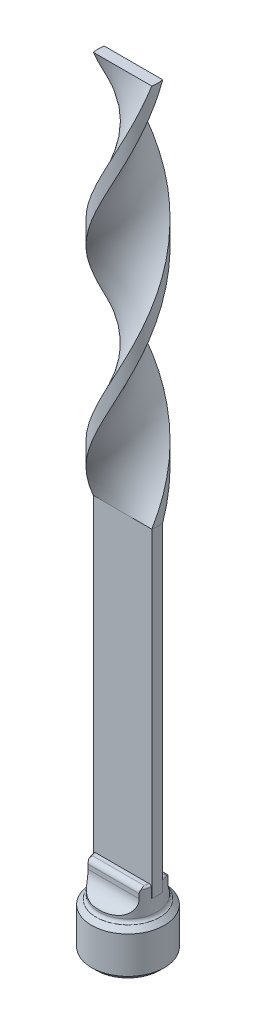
ISO-10303-21;
HEADER;
FILE_DESCRIPTION(('STEP AP214'),'2;1');
FILE_NAME('part.step','',(''),(''),'','','');
FILE_SCHEMA(('AUTOMOTIVE_DESIGN { 1 0 10303 214 1 1 1 1 }'));
ENDSEC;
DATA;
#1=APPLICATION_CONTEXT('core data for automotive mechanical design processes');
#2=APPLICATION_PROTOCOL_DEFINITION('international standard','automotive_design',2000,#1);
#3=PRODUCT_CONTEXT('',#1,'mechanical');
#4=PRODUCT('Part','Part','',(#3));
#5=PRODUCT_RELATED_PRODUCT_CATEGORY('part','',(#4));
#6=PRODUCT_DEFINITION_FORMATION('','',#4);
#7=PRODUCT_DEFINITION_CONTEXT('part definition',#1,'design');
#8=PRODUCT_DEFINITION('design','',#6,#7);
#9=PRODUCT_DEFINITION_SHAPE('','',#8);
#10=(LENGTH_UNIT() NAMED_UNIT(*) SI_UNIT(.MILLI.,.METRE.));
#11=(NAMED_UNIT(*) PLANE_ANGLE_UNIT() SI_UNIT($,.RADIAN.));
#12=(NAMED_UNIT(*) SI_UNIT($,.STERADIAN.) SOLID_ANGLE_UNIT());
#13=UNCERTAINTY_MEASURE_WITH_UNIT(LENGTH_MEASURE(1.E-05),#10,'distance_accuracy_value','');
#14=(GEOMETRIC_REPRESENTATION_CONTEXT(3) GLOBAL_UNCERTAINTY_ASSIGNED_CONTEXT((#13)) GLOBAL_UNIT_ASSIGNED_CONTEXT((#10,
#11,#12)) REPRESENTATION_CONTEXT('',''));
#15=CARTESIAN_POINT('',(0.,0.,0.));
#16=DIRECTION('',(0.,0.,1.));
#17=DIRECTION('',(1.,0.,0.));
#18=AXIS2_PLACEMENT_3D('',#15,#16,#17);
#19=CARTESIAN_POINT('',(-2.3622,0.,1.36381680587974));
#20=DIRECTION('',(-0.5,0.,0.866025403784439));
#21=DIRECTION('',(0.866025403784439,0.,0.5));
#22=AXIS2_PLACEMENT_3D('',#19,#20,#21);
#23=PLANE('',#22);
#24=DIRECTION('',(0.,1.,0.));
#25=VECTOR('',#24,1.);
#26=CARTESIAN_POINT('',(-2.3622,0.,1.36381680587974));
#27=LINE('',#26,#25);
#28=CARTESIAN_POINT('',(-2.36219999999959,0.0155663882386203,1.3638168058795));
#29=VERTEX_POINT('',#28);
#30=CARTESIAN_POINT('',(-2.3622,5.4102,1.36381680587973));
#31=VERTEX_POINT('',#30);
#32=EDGE_CURVE('E666',#29,#31,#27,.T.);
#33=ORIENTED_EDGE('',*,*,#32,.T.);
#34=DIRECTION('',(-0.866025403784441,0.,-0.5));
#35=VECTOR('',#34,1.);
#36=CARTESIAN_POINT('',(0.,5.4102,2.72763361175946));
#37=LINE('',#36,#35);
#38=CARTESIAN_POINT('',(0.,5.4102,2.72763361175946));
#39=VERTEX_POINT('',#38);
#40=EDGE_CURVE('E659',#39,#31,#37,.T.);
#41=ORIENTED_EDGE('',*,*,#40,.F.);
#42=DIRECTION('',(0.,1.,0.));
#43=VECTOR('',#42,1.);
#44=CARTESIAN_POINT('',(0.,0.,2.72763361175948));
#45=LINE('',#44,#43);
#46=CARTESIAN_POINT('',(-4.05896796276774E-13,0.0155663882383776,2.72763361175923));
#47=VERTEX_POINT('',#46);
#48=EDGE_CURVE('E336',#39,#47,#45,.F.);
#49=ORIENTED_EDGE('',*,*,#48,.T.);
#50=CARTESIAN_POINT('',(-2.36219999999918,0.0155663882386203,1.36381680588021));
#51=CARTESIAN_POINT('',(-2.28154043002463,0.0620917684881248,1.41038563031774));
#52=CARTESIAN_POINT('',(-2.19954081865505,0.105900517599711,1.45772812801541));
#53=CARTESIAN_POINT('',(-2.03230420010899,0.186202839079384,1.55428223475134));
#54=CARTESIAN_POINT('',(-1.94704980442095,0.222647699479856,1.60350388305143));
#55=CARTESIAN_POINT('',(-1.77407702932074,0.28558015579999,1.70336976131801));
#56=CARTESIAN_POINT('',(-1.686368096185,0.312101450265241,1.75400853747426));
#57=CARTESIAN_POINT('',(-1.50902744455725,0.352932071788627,1.85639621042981));
#58=CARTESIAN_POINT('',(-1.41940256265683,0.367279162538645,1.9081411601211));
#59=CARTESIAN_POINT('',(-1.3047260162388,0.376863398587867,1.97434969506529));
#60=CARTESIAN_POINT('',(-1.28001324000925,0.37841288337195,1.98861762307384));
#61=CARTESIAN_POINT('',(-1.23056804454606,0.38048128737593,2.01716481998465));
#62=CARTESIAN_POINT('',(-1.20583564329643,0.381000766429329,2.03144407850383));
#63=CARTESIAN_POINT('',(-1.11901839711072,0.38099807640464,2.08156803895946));
#64=CARTESIAN_POINT('',(-1.0569163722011,0.377719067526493,2.11742265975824));
#65=CARTESIAN_POINT('',(-0.933187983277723,0.364783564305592,2.18885727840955));
#66=CARTESIAN_POINT('',(-0.87156198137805,0.355122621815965,2.22443706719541));
#67=CARTESIAN_POINT('',(-0.748942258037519,0.329877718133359,2.29523159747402));
#68=CARTESIAN_POINT('',(-0.68795279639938,0.314266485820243,2.33044387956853));
#69=CARTESIAN_POINT('',(-0.567144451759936,0.277831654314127,2.40019260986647));
#70=CARTESIAN_POINT('',(-0.507326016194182,0.25700610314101,2.43472879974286));
#71=CARTESIAN_POINT('',(-0.370927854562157,0.203889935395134,2.51347831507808));
#72=CARTESIAN_POINT('',(-0.294808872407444,0.170040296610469,2.55742562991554));
#73=CARTESIAN_POINT('',(-0.145452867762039,0.0966774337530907,2.64365635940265));
#74=CARTESIAN_POINT('',(-0.0721958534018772,0.0572188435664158,2.68595131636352));
#75=CARTESIAN_POINT('',(-8.22908622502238E-13,0.0155663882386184,2.72763361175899));
#76=B_SPLINE_CURVE_WITH_KNOTS('',3,(#50,#51,#52,#53,#54,#55,#56,#57,#58,#59,#60,#61,#62,#63,#64,
#65,#66,#67,#68,#69,#70,#71,#72,#73,#74,#75),.UNSPECIFIED.,.F.,.F.,(4,2,2,2,2,2,2,2,2,2,2,2,4),
(0.,0.312550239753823,0.627104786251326,0.940581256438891,1.25308174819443,1.33880263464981,
1.42447691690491,1.63950252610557,1.85467816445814,2.07085208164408,2.28710704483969,
2.56941094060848,2.84913273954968),.UNSPECIFIED.);
#77=EDGE_CURVE('E298',#29,#47,#76,.T.);
#78=ORIENTED_EDGE('',*,*,#77,.F.);
#79=EDGE_LOOP('',(#33,#41,#49,#78));
#80=FACE_BOUND('',#79,.T.);
#81=ADVANCED_FACE('F15',(#80),#23,.F.);
#82=CARTESIAN_POINT('',(-2.3622,0.,-1.36381680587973));
#83=DIRECTION('',(-1.,0.,0.));
#84=DIRECTION('',(0.,0.,1.));
#85=AXIS2_PLACEMENT_3D('',#82,#83,#84);
#86=PLANE('',#85);
#87=DIRECTION('',(0.,1.,0.));
#88=VECTOR('',#87,1.);
#89=CARTESIAN_POINT('',(-2.3622,0.,-1.36381680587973));
#90=LINE('',#89,#88);
#91=CARTESIAN_POINT('',(-2.36219999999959,0.0155663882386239,-1.36381680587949));
#92=VERTEX_POINT('',#91);
#93=CARTESIAN_POINT('',(-2.3622,5.4102,-1.36381680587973));
#94=VERTEX_POINT('',#93);
#95=EDGE_CURVE('E335',#92,#94,#90,.T.);
#96=ORIENTED_EDGE('',*,*,#95,.T.);
#97=DIRECTION('',(0.,0.,-1.));
#98=VECTOR('',#97,1.);
#99=CARTESIAN_POINT('',(-2.3622,5.4102,0.));
#100=LINE('',#99,#98);
#101=EDGE_CURVE('E662',#31,#94,#100,.T.);
#102=ORIENTED_EDGE('',*,*,#101,.F.);
#103=ORIENTED_EDGE('',*,*,#32,.F.);
#104=CARTESIAN_POINT('',(-2.3622,0.015566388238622,-1.36381680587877));
#105=CARTESIAN_POINT('',(-2.3622,0.0620917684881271,-1.27067915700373));
#106=CARTESIAN_POINT('',(-2.3622,0.105900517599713,-1.17599416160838));
#107=CARTESIAN_POINT('',(-2.3622,0.186202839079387,-0.982885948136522));
#108=CARTESIAN_POINT('',(-2.3622,0.222647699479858,-0.884442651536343));
#109=CARTESIAN_POINT('',(-2.3622,0.285580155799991,-0.684710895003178));
#110=CARTESIAN_POINT('',(-2.3622,0.312101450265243,-0.583433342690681));
#111=CARTESIAN_POINT('',(-2.3622,0.352932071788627,-0.378657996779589));
#112=CARTESIAN_POINT('',(-2.3622,0.367279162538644,-0.275168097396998));
#113=CARTESIAN_POINT('',(-2.3622,0.376863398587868,-0.142751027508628));
#114=CARTESIAN_POINT('',(-2.3622,0.37841288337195,-0.11421517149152));
#115=CARTESIAN_POINT('',(-2.3622,0.380481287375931,-0.0571207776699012));
#116=CARTESIAN_POINT('',(-2.3622,0.38100076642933,-0.0285622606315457));
#117=CARTESIAN_POINT('',(-2.3622,0.38099807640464,0.0716856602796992));
#118=CARTESIAN_POINT('',(-2.3622,0.377719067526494,0.143394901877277));
#119=CARTESIAN_POINT('',(-2.3622,0.364783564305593,0.286264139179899));
#120=CARTESIAN_POINT('',(-2.3622,0.355122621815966,0.357423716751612));
#121=CARTESIAN_POINT('',(-2.3622,0.329877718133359,0.499012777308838));
#122=CARTESIAN_POINT('',(-2.3622,0.314266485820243,0.569437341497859));
#123=CARTESIAN_POINT('',(-2.3622,0.277831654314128,0.70893480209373));
#124=CARTESIAN_POINT('',(-2.3622,0.257006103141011,0.778007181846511));
#125=CARTESIAN_POINT('',(-2.3622,0.203889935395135,0.93550621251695));
#126=CARTESIAN_POINT('',(-2.3622,0.170040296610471,1.02340084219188));
#127=CARTESIAN_POINT('',(-2.3622,0.0966774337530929,1.1958623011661));
#128=CARTESIAN_POINT('',(-2.3622,0.0572188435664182,1.28045221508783));
#129=CARTESIAN_POINT('',(-2.3622,0.0155663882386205,1.36381680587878));
#130=B_SPLINE_CURVE_WITH_KNOTS('',3,(#104,#105,#106,#107,#108,#109,#110,#111,#112,#113,#114,
#115,#116,#117,#118,#119,#120,#121,#122,#123,#124,#125,#126,#127,#128,#129),.UNSPECIFIED.,.F.,
.F.,(4,2,2,2,2,2,2,2,2,2,2,2,4),(0.,0.312550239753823,0.627104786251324,0.940581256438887,
1.25308174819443,1.3388026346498,1.42447691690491,1.63950252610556,1.85467816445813,
2.07085208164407,2.28710704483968,2.56941094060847,2.84913273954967),.UNSPECIFIED.);
#131=EDGE_CURVE('E131',#92,#29,#130,.T.);
#132=ORIENTED_EDGE('',*,*,#131,.F.);
#133=EDGE_LOOP('',(#96,#102,#103,#132));
#134=FACE_BOUND('',#133,.T.);
#135=ADVANCED_FACE('F345',(#134),#86,.F.);
#136=CARTESIAN_POINT('',(0.,0.,2.72763361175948));
#137=DIRECTION('',(0.5,0.,0.866025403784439));
#138=DIRECTION('',(0.866025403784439,0.,-0.5));
#139=AXIS2_PLACEMENT_3D('',#136,#137,#138);
#140=PLANE('',#139);
#141=ORIENTED_EDGE('',*,*,#48,.F.);
#142=DIRECTION('',(-0.866025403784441,0.,0.5));
#143=VECTOR('',#142,1.);
#144=CARTESIAN_POINT('',(2.3622,5.4102,1.36381680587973));
#145=LINE('',#144,#143);
#146=CARTESIAN_POINT('',(2.3622,5.4102,1.36381680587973));
#147=VERTEX_POINT('',#146);
#148=EDGE_CURVE('E663',#147,#39,#145,.T.);
#149=ORIENTED_EDGE('',*,*,#148,.F.);
#150=DIRECTION('',(0.,1.,0.));
#151=VECTOR('',#150,1.);
#152=CARTESIAN_POINT('',(2.3622,0.,1.36381680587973));
#153=LINE('',#152,#151);
#154=CARTESIAN_POINT('',(2.36219999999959,0.0155663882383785,1.36381680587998));
#155=VERTEX_POINT('',#154);
#156=EDGE_CURVE('E699',#147,#155,#153,.F.);
#157=ORIENTED_EDGE('',*,*,#156,.T.);
#158=CARTESIAN_POINT('',(8.34335602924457E-13,0.0155663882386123,2.727633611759));
#159=CARTESIAN_POINT('',(0.0806595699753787,0.0620917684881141,2.68106478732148));
#160=CARTESIAN_POINT('',(0.162659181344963,0.105900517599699,2.63372228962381));
#161=CARTESIAN_POINT('',(0.329895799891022,0.186202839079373,2.53716818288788));
#162=CARTESIAN_POINT('',(0.415150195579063,0.222647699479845,2.48794653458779));
#163=CARTESIAN_POINT('',(0.588122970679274,0.285580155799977,2.3880806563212));
#164=CARTESIAN_POINT('',(0.675831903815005,0.312101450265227,2.33744188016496));
#165=CARTESIAN_POINT('',(0.853172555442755,0.352932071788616,2.23505420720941));
#166=CARTESIAN_POINT('',(0.942797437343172,0.367279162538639,2.18330925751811));
#167=CARTESIAN_POINT('',(1.0574739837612,0.376863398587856,2.11710072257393));
#168=CARTESIAN_POINT('',(1.08218675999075,0.378412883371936,2.10283279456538));
#169=CARTESIAN_POINT('',(1.13163195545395,0.380481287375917,2.07428559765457));
#170=CARTESIAN_POINT('',(1.15636435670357,0.381000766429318,2.06000633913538));
#171=CARTESIAN_POINT('',(1.24318160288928,0.380998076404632,2.00988237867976));
#172=CARTESIAN_POINT('',(1.3052836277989,0.377719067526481,1.97402775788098));
#173=CARTESIAN_POINT('',(1.42901201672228,0.364783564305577,1.90259313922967));
#174=CARTESIAN_POINT('',(1.49063801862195,0.355122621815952,1.86701335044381));
#175=CARTESIAN_POINT('',(1.61325774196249,0.329877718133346,1.7962188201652));
#176=CARTESIAN_POINT('',(1.67424720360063,0.314266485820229,1.76100653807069));
#177=CARTESIAN_POINT('',(1.79505554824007,0.277831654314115,1.69125780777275));
#178=CARTESIAN_POINT('',(1.85487398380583,0.257006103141,1.65672161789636));
#179=CARTESIAN_POINT('',(1.99127214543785,0.203889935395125,1.57797210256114));
#180=CARTESIAN_POINT('',(2.06739112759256,0.170040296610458,1.53402478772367));
#181=CARTESIAN_POINT('',(2.21674713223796,0.096677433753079,1.44779405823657));
#182=CARTESIAN_POINT('',(2.29000414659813,0.0572188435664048,1.4054991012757));
#183=CARTESIAN_POINT('',(2.36219999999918,0.0155663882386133,1.36381680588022));
#184=B_SPLINE_CURVE_WITH_KNOTS('',3,(#158,#159,#160,#161,#162,#163,#164,#165,#166,#167,#168,
#169,#170,#171,#172,#173,#174,#175,#176,#177,#178,#179,#180,#181,#182,#183),.UNSPECIFIED.,.F.,
.F.,(4,2,2,2,2,2,2,2,2,2,2,2,4),(0.,0.31255023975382,0.627104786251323,0.940581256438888,
1.25308174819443,1.3388026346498,1.4244769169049,1.63950252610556,1.85467816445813,
2.07085208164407,2.28710704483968,2.56941094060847,2.84913273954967),.UNSPECIFIED.);
#185=EDGE_CURVE('E329',#47,#155,#184,.T.);
#186=ORIENTED_EDGE('',*,*,#185,.F.);
#187=EDGE_LOOP('',(#141,#149,#157,#186));
#188=FACE_BOUND('',#187,.T.);
#189=ADVANCED_FACE('F341',(#188),#140,.F.);
#190=CARTESIAN_POINT('',(0.,0.,-2.72763361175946));
#191=DIRECTION('',(-0.5,0.,-0.866025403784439));
#192=DIRECTION('',(-0.866025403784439,0.,0.5));
#193=AXIS2_PLACEMENT_3D('',#190,#191,#192);
#194=PLANE('',#193);
#195=DIRECTION('',(0.,1.,0.));
#196=VECTOR('',#195,1.);
#197=CARTESIAN_POINT('',(0.,0.,-2.72763361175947));
#198=LINE('',#197,#196);
#199=CARTESIAN_POINT('',(0.,0.0155663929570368,-2.72763360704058));
#200=VERTEX_POINT('',#199);
#201=CARTESIAN_POINT('',(0.,5.4102,-2.72763361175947));
#202=VERTEX_POINT('',#201);
#203=EDGE_CURVE('E694',#200,#202,#198,.T.);
#204=ORIENTED_EDGE('',*,*,#203,.T.);
#205=DIRECTION('',(0.866025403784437,0.,-0.5));
#206=VECTOR('',#205,1.);
#207=CARTESIAN_POINT('',(-2.3622,5.4102,-1.36381680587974));
#208=LINE('',#207,#206);
#209=EDGE_CURVE('E672',#94,#202,#208,.T.);
#210=ORIENTED_EDGE('',*,*,#209,.F.);
#211=ORIENTED_EDGE('',*,*,#95,.F.);
#212=CARTESIAN_POINT('',(-6.58945370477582E-09,0.0155663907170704,-2.72763360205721));
#213=CARTESIAN_POINT('',(-0.0806595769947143,0.0620917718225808,-2.6810647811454));
#214=CARTESIAN_POINT('',(-0.162659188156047,0.105900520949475,-2.63372228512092));
#215=CARTESIAN_POINT('',(-0.329895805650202,0.186202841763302,-2.53716818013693));
#216=CARTESIAN_POINT('',(-0.415150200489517,0.222647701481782,-2.48794653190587));
#217=CARTESIAN_POINT('',(-0.588122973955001,0.285580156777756,-2.3880806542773));
#218=CARTESIAN_POINT('',(-0.675831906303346,0.312101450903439,-2.337441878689));
#219=CARTESIAN_POINT('',(-0.853172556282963,0.352932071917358,-2.23505420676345));
#220=CARTESIAN_POINT('',(-0.942797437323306,0.367279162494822,-2.18330925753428));
#221=CARTESIAN_POINT('',(-1.05747398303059,0.376863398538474,-2.11710072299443));
#222=CARTESIAN_POINT('',(-1.08218675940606,0.378412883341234,-2.10283279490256));
#223=CARTESIAN_POINT('',(-1.13163195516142,0.380481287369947,-2.07428559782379));
#224=CARTESIAN_POINT('',(-1.15636435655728,0.3810007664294,-2.06000633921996));
#225=CARTESIAN_POINT('',(-1.24318160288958,0.380998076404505,-2.00988237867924));
#226=CARTESIAN_POINT('',(-1.30528362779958,0.377719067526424,-1.97402775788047));
#227=CARTESIAN_POINT('',(-1.42901201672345,0.364783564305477,-1.90259313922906));
#228=CARTESIAN_POINT('',(-1.49063801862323,0.355122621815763,-1.86701335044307));
#229=CARTESIAN_POINT('',(-1.61325774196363,0.329877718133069,-1.79621882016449));
#230=CARTESIAN_POINT('',(-1.67424720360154,0.314266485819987,-1.76100653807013));
#231=CARTESIAN_POINT('',(-1.79505554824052,0.277831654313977,-1.69125780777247));
#232=CARTESIAN_POINT('',(-1.85487398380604,0.257006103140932,-1.65672161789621));
#233=CARTESIAN_POINT('',(-1.99127214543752,0.203889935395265,-1.5779721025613));
#234=CARTESIAN_POINT('',(-2.06739112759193,0.170040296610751,-1.53402478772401));
#235=CARTESIAN_POINT('',(-2.21674713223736,0.0966774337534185,-1.44779405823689));
#236=CARTESIAN_POINT('',(-2.29000414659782,0.0572188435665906,-1.40549910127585));
#237=CARTESIAN_POINT('',(-2.36219999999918,0.0155663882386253,-1.3638168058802));
#238=B_SPLINE_CURVE_WITH_KNOTS('',3,(#212,#213,#214,#215,#216,#217,#218,#219,#220,#221,#222,
#223,#224,#225,#226,#227,#228,#229,#230,#231,#232,#233,#234,#235,#236,#237),.UNSPECIFIED.,.F.,
.F.,(4,2,2,2,2,2,2,2,2,2,2,2,4),(0.,0.312550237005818,0.627104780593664,0.940581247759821,
1.25308173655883,1.33880262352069,1.42447690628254,1.63950251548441,1.8546781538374,
2.07085207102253,2.28710703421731,2.56941092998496,2.84913272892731),.UNSPECIFIED.);
#239=EDGE_CURVE('E322',#200,#92,#238,.T.);
#240=ORIENTED_EDGE('',*,*,#239,.F.);
#241=EDGE_LOOP('',(#204,#210,#211,#240));
#242=FACE_BOUND('',#241,.T.);
#243=ADVANCED_FACE('F344',(#242),#194,.F.);
#244=CARTESIAN_POINT('',(0.,5.4102,0.));
#245=DIRECTION('',(0.,-1.,0.));
#246=DIRECTION('',(0.,0.,-1.));
#247=AXIS2_PLACEMENT_3D('',#244,#245,#246);
#248=PLANE('',#247);
#249=ORIENTED_EDGE('',*,*,#101,.T.);
#250=ORIENTED_EDGE('',*,*,#209,.T.);
#251=DIRECTION('',(-0.866025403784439,0.,-0.5));
#252=VECTOR('',#251,1.);
#253=CARTESIAN_POINT('',(2.3622,5.4102,-1.36381680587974));
#254=LINE('',#253,#252);
#255=CARTESIAN_POINT('',(2.3622,5.4102,-1.36381680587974));
#256=VERTEX_POINT('',#255);
#257=EDGE_CURVE('E691',#202,#256,#254,.F.);
#258=ORIENTED_EDGE('',*,*,#257,.T.);
#259=DIRECTION('',(0.,0.,-1.));
#260=VECTOR('',#259,1.);
#261=CARTESIAN_POINT('',(2.3622,5.4102,1.36381680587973));
#262=LINE('',#261,#260);
#263=EDGE_CURVE('E688',#256,#147,#262,.F.);
#264=ORIENTED_EDGE('',*,*,#263,.T.);
#265=ORIENTED_EDGE('',*,*,#148,.T.);
#266=ORIENTED_EDGE('',*,*,#40,.T.);
#267=EDGE_LOOP('',(#249,#250,#258,#264,#265,#266));
#268=FACE_BOUND('',#267,.T.);
#269=ADVANCED_FACE('F1106',(#268),#248,.T.);
#270=CARTESIAN_POINT('',(2.3622,0.,1.36381680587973));
#271=DIRECTION('',(1.,0.,0.));
#272=DIRECTION('',(0.,0.,-1.));
#273=AXIS2_PLACEMENT_3D('',#270,#271,#272);
#274=PLANE('',#273);
#275=ORIENTED_EDGE('',*,*,#156,.F.);
#276=ORIENTED_EDGE('',*,*,#263,.F.);
#277=DIRECTION('',(0.,1.,0.));
#278=VECTOR('',#277,1.);
#279=CARTESIAN_POINT('',(2.3622,0.,-1.36381680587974));
#280=LINE('',#279,#278);
#281=CARTESIAN_POINT('',(2.3622,0.0155663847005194,-1.36381681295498));
#282=VERTEX_POINT('',#281);
#283=EDGE_CURVE('E693',#256,#282,#280,.F.);
#284=ORIENTED_EDGE('',*,*,#283,.T.);
#285=CARTESIAN_POINT('',(2.3622,0.0155663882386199,1.36381680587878));
#286=CARTESIAN_POINT('',(2.3622,0.062091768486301,1.27067915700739));
#287=CARTESIAN_POINT('',(2.3622,0.105900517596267,1.17599416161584));
#288=CARTESIAN_POINT('',(2.3622,0.186202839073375,0.982885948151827));
#289=CARTESIAN_POINT('',(2.3622,0.222647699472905,0.884442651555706));
#290=CARTESIAN_POINT('',(2.3622,0.285580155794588,0.684710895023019));
#291=CARTESIAN_POINT('',(2.3622,0.312101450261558,0.583433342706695));
#292=CARTESIAN_POINT('',(2.3622,0.352932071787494,0.378657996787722));
#293=CARTESIAN_POINT('',(2.3622,0.367279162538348,0.275168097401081));
#294=CARTESIAN_POINT('',(2.3622,0.376863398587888,0.142751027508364));
#295=CARTESIAN_POINT('',(2.3622,0.37841288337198,0.114215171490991));
#296=CARTESIAN_POINT('',(2.3622,0.380481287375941,0.057120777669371));
#297=CARTESIAN_POINT('',(2.3622,0.38100076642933,0.0285622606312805));
#298=CARTESIAN_POINT('',(2.3622,0.380998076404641,-0.0716856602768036));
#299=CARTESIAN_POINT('',(2.3622,0.377719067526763,-0.143394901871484));
#300=CARTESIAN_POINT('',(2.3622,0.364783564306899,-0.286264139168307));
#301=CARTESIAN_POINT('',(2.3622,0.355122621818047,-0.35742371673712));
#302=CARTESIAN_POINT('',(2.3622,0.329877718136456,-0.499012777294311));
#303=CARTESIAN_POINT('',(2.3622,0.314266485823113,-0.569437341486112));
#304=CARTESIAN_POINT('',(2.3622,0.277831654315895,-0.708934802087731));
#305=CARTESIAN_POINT('',(2.3622,0.257006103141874,-0.778007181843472));
#306=CARTESIAN_POINT('',(2.3622,0.203889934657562,-0.935506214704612));
#307=CARTESIAN_POINT('',(2.3622,0.170040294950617,-1.02340084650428));
#308=CARTESIAN_POINT('',(2.3622,0.096677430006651,-1.19586230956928));
#309=CARTESIAN_POINT('',(2.3622,0.0572188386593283,-1.28045222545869));
#310=CARTESIAN_POINT('',(2.3622,0.0155663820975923,-1.36381681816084));
#311=B_SPLINE_CURVE_WITH_KNOTS('',3,(#285,#286,#287,#288,#289,#290,#291,#292,#293,#294,#295,
#296,#297,#298,#299,#300,#301,#302,#303,#304,#305,#306,#307,#308,#309,#310),.UNSPECIFIED.,.F.,
.F.,(4,2,2,2,2,2,2,2,2,2,2,2,4),(0.,0.312550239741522,0.627104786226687,0.940581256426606,
1.25308174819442,1.33880263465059,1.4244769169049,1.63950252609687,1.85467816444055,
2.07085208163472,2.28710704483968,2.5694109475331,2.84913275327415),.UNSPECIFIED.);
#312=EDGE_CURVE('E316',#155,#282,#311,.T.);
#313=ORIENTED_EDGE('',*,*,#312,.F.);
#314=EDGE_LOOP('',(#275,#276,#284,#313));
#315=FACE_BOUND('',#314,.T.);
#316=ADVANCED_FACE('F1115',(#315),#274,.F.);
#317=CARTESIAN_POINT('',(2.3622,0.,-1.36381680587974));
#318=DIRECTION('',(0.5,0.,-0.866025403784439));
#319=DIRECTION('',(-0.866025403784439,0.,-0.5));
#320=AXIS2_PLACEMENT_3D('',#317,#318,#319);
#321=PLANE('',#320);
#322=ORIENTED_EDGE('',*,*,#283,.F.);
#323=ORIENTED_EDGE('',*,*,#257,.F.);
#324=ORIENTED_EDGE('',*,*,#203,.F.);
#325=CARTESIAN_POINT('',(8.17335955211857E-09,0.0155663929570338,-2.72763360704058));
#326=CARTESIAN_POINT('',(0.0806595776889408,0.0620917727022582,-2.68106478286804));
#327=CARTESIAN_POINT('',(0.16265918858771,0.105900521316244,-2.63372228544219));
#328=CARTESIAN_POINT('',(0.32989580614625,0.186202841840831,-2.5371681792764));
#329=CARTESIAN_POINT('',(0.41515020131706,0.222647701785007,-2.48794653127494));
#330=CARTESIAN_POINT('',(0.588122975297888,0.285580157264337,-2.38808065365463));
#331=CARTESIAN_POINT('',(0.675831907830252,0.31210145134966,-2.33744187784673));
#332=CARTESIAN_POINT('',(0.853172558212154,0.352932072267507,-2.23505420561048));
#333=CARTESIAN_POINT('',(0.942797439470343,0.367279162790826,-2.18330925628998));
#334=CARTESIAN_POINT('',(1.05747398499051,0.376863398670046,-2.11710072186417));
#335=CARTESIAN_POINT('',(1.08218676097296,0.378412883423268,-2.10283279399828));
#336=CARTESIAN_POINT('',(1.13163195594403,0.380481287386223,-2.0742855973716));
#337=CARTESIAN_POINT('',(1.15636435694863,0.381000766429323,-2.06000633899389));
#338=CARTESIAN_POINT('',(1.24318160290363,0.380998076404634,-2.00988237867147));
#339=CARTESIAN_POINT('',(1.30528362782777,0.377719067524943,-1.9740277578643));
#340=CARTESIAN_POINT('',(1.4290120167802,0.364783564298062,-1.90259313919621));
#341=CARTESIAN_POINT('',(1.4906380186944,0.355122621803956,-1.86701335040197));
#342=CARTESIAN_POINT('',(1.61325774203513,0.329877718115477,-1.79621882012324));
#343=CARTESIAN_POINT('',(1.67424720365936,0.314266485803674,-1.76100653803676));
#344=CARTESIAN_POINT('',(1.79505554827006,0.277831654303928,-1.69125780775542));
#345=CARTESIAN_POINT('',(1.85487398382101,0.257006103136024,-1.65672161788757));
#346=CARTESIAN_POINT('',(1.99127213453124,0.203889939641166,-1.57797210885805));
#347=CARTESIAN_POINT('',(2.06739110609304,0.170040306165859,-1.53402480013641));
#348=CARTESIAN_POINT('',(2.21674709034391,0.0966774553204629,-1.4477940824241));
#349=CARTESIAN_POINT('',(2.29000409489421,0.0572188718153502,-1.40549913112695));
#350=CARTESIAN_POINT('',(2.362199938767,0.0155664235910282,-1.36381684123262));
#351=B_SPLINE_CURVE_WITH_KNOTS('',3,(#325,#326,#327,#328,#329,#330,#331,#332,#333,#334,#335,
#336,#337,#338,#339,#340,#341,#342,#343,#344,#345,#346,#347,#348,#349,#350),.UNSPECIFIED.,.F.,
.F.,(4,2,2,2,2,2,2,2,2,2,2,2,4),(0.,0.312550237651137,0.627104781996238,0.940581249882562,
1.25308173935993,1.33880262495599,1.42447690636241,1.63950251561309,1.85467815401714,
2.07085207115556,2.28710703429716,2.56941089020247,2.84913264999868),.UNSPECIFIED.);
#352=EDGE_CURVE('E308',#200,#282,#351,.T.);
#353=ORIENTED_EDGE('',*,*,#352,.T.);
#354=EDGE_LOOP('',(#322,#323,#324,#353));
#355=FACE_BOUND('',#354,.T.);
#356=ADVANCED_FACE('F291',(#355),#321,.F.);
#357=CARTESIAN_POINT('',(0.,-5.68440337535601E-11,0.));
#358=DIRECTION('',(0.,-1.,0.));
#359=DIRECTION('',(0.,0.,-1.));
#360=AXIS2_PLACEMENT_3D('',#357,#358,#359);
#361=CONICAL_SURFACE('',#360,2.74320000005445,0.785398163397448);
#362=CARTESIAN_POINT('',(0.,-5.68444674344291E-11,0.));
#363=DIRECTION('',(0.,-1.,0.));
#364=DIRECTION('',(0.,0.,-1.));
#365=AXIS2_PLACEMENT_3D('',#362,#363,#364);
#366=CIRCLE('',#365,2.74320000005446);
#367=CARTESIAN_POINT('',(0.,-5.68450823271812E-11,-2.74320000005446));
#368=VERTEX_POINT('',#367);
#369=EDGE_CURVE('E723',#368,#368,#366,.F.);
#370=ORIENTED_EDGE('',*,*,#369,.F.);
#371=EDGE_LOOP('',(#370));
#372=FACE_BOUND('',#371,.T.);
#373=ORIENTED_EDGE('',*,*,#352,.F.);
#374=ORIENTED_EDGE('',*,*,#239,.T.);
#375=ORIENTED_EDGE('',*,*,#131,.T.);
#376=ORIENTED_EDGE('',*,*,#77,.T.);
#377=ORIENTED_EDGE('',*,*,#185,.T.);
#378=ORIENTED_EDGE('',*,*,#312,.T.);
#379=EDGE_LOOP('',(#373,#374,#375,#376,#377,#378));
#380=FACE_BOUND('',#379,.T.);
#381=ADVANCED_FACE('F286',(#372,#380),#361,.F.);
#382=CARTESIAN_POINT('',(0.,0.,-2.3622));
#383=DIRECTION('',(0.,-1.,0.));
#384=DIRECTION('',(0.,0.,-1.));
#385=AXIS2_PLACEMENT_3D('',#382,#383,#384);
#386=PLANE('',#385);
#387=ORIENTED_EDGE('',*,*,#369,.T.);
#388=EDGE_LOOP('',(#387));
#389=FACE_BOUND('',#388,.T.);
#390=CARTESIAN_POINT('',(0.,-1.13686946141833E-10,0.));
#391=DIRECTION('',(0.,1.,0.));
#392=DIRECTION('',(0.,0.,1.));
#393=AXIS2_PLACEMENT_3D('',#390,#391,#392);
#394=CIRCLE('',#393,4.19099999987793);
#395=CARTESIAN_POINT('',(0.,-1.13686001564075E-10,4.19099999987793));
#396=VERTEX_POINT('',#395);
#397=EDGE_CURVE('E718',#396,#396,#394,.T.);
#398=ORIENTED_EDGE('',*,*,#397,.F.);
#399=EDGE_LOOP('',(#398));
#400=FACE_BOUND('',#399,.T.);
#401=ADVANCED_FACE('F282',(#389,#400),#386,.T.);
#402=CARTESIAN_POINT('',(0.,0.619499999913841,0.));
#403=DIRECTION('',(0.,1.,0.));
#404=DIRECTION('',(0.,0.,1.));
#405=AXIS2_PLACEMENT_3D('',#402,#403,#404);
#406=CONICAL_SURFACE('',#405,4.81049999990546,0.785398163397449);
#407=CARTESIAN_POINT('',(0.,0.6195,0.));
#408=DIRECTION('',(0.,-1.,0.));
#409=DIRECTION('',(0.,0.,-1.));
#410=AXIS2_PLACEMENT_3D('',#407,#408,#409);
#411=CIRCLE('',#410,4.8105);
#412=CARTESIAN_POINT('',(0.,0.619499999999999,-4.8105));
#413=VERTEX_POINT('',#412);
#414=EDGE_CURVE('E714',#413,#413,#411,.F.);
#415=ORIENTED_EDGE('',*,*,#414,.F.);
#416=EDGE_LOOP('',(#415));
#417=FACE_BOUND('',#416,.T.);
#418=ORIENTED_EDGE('',*,*,#397,.T.);
#419=EDGE_LOOP('',(#418));
#420=FACE_BOUND('',#419,.T.);
#421=ADVANCED_FACE('F278',(#417,#420),#406,.T.);
#422=CARTESIAN_POINT('',(0.,3.048,0.));
#423=DIRECTION('',(0.,-1.,0.));
#424=DIRECTION('',(0.,0.,-1.));
#425=AXIS2_PLACEMENT_3D('',#422,#423,#424);
#426=CYLINDRICAL_SURFACE('',#425,4.8105);
#427=CARTESIAN_POINT('',(0.,5.47649999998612,0.));
#428=DIRECTION('',(0.,-1.,0.));
#429=DIRECTION('',(0.,0.,1.));
#430=AXIS2_PLACEMENT_3D('',#427,#428,#429);
#431=CIRCLE('',#430,4.81050000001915);
#432=CARTESIAN_POINT('',(0.,5.47649999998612,4.81050000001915));
#433=VERTEX_POINT('',#432);
#434=EDGE_CURVE('E711',#433,#433,#431,.F.);
#435=ORIENTED_EDGE('',*,*,#434,.F.);
#436=EDGE_LOOP('',(#435));
#437=FACE_BOUND('',#436,.T.);
#438=ORIENTED_EDGE('',*,*,#414,.T.);
#439=EDGE_LOOP('',(#438));
#440=FACE_BOUND('',#439,.T.);
#441=ADVANCED_FACE('F274',(#437,#440),#426,.T.);
#442=CARTESIAN_POINT('',(0.,5.4765000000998,0.));
#443=DIRECTION('',(0.,-1.,0.));
#444=DIRECTION('',(0.,0.,-1.));
#445=AXIS2_PLACEMENT_3D('',#442,#443,#444);
#446=CONICAL_SURFACE('',#445,4.81049999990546,0.785398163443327);
#447=CARTESIAN_POINT('',(0.,6.096,0.));
#448=DIRECTION('',(0.,-1.,0.));
#449=DIRECTION('',(0.,0.,-1.));
#450=AXIS2_PLACEMENT_3D('',#447,#448,#449);
#451=CIRCLE('',#450,4.191);
#452=CARTESIAN_POINT('',(0.,6.096,-4.191));
#453=VERTEX_POINT('',#452);
#454=EDGE_CURVE('E240',#453,#453,#451,.T.);
#455=ORIENTED_EDGE('',*,*,#454,.T.);
#456=EDGE_LOOP('',(#455));
#457=FACE_BOUND('',#456,.T.);
#458=ORIENTED_EDGE('',*,*,#434,.T.);
#459=EDGE_LOOP('',(#458));
#460=FACE_BOUND('',#459,.T.);
#461=ADVANCED_FACE('F268',(#457,#460),#446,.T.);
#462=CARTESIAN_POINT('',(0.,6.5615896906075,0.));
#463=DIRECTION('',(0.,-1.,0.));
#464=DIRECTION('',(0.,0.,-1.));
#465=AXIS2_PLACEMENT_3D('',#462,#463,#464);
#466=TOROIDAL_SURFACE('',#465,4.39420000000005,0.508);
#467=ORIENTED_EDGE('',*,*,#454,.F.);
#468=EDGE_LOOP('',(#467));
#469=FACE_BOUND('',#468,.T.);
#470=CARTESIAN_POINT('',(0.,6.5615896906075,0.));
#471=DIRECTION('',(0.,-1.,0.));
#472=DIRECTION('',(0.,0.,-1.));
#473=AXIS2_PLACEMENT_3D('',#470,#471,#472);
#474=CIRCLE('',#473,3.8862);
#475=CARTESIAN_POINT('',(0.,6.5615896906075,-3.8862));
#476=VERTEX_POINT('',#475);
#477=EDGE_CURVE('E237',#476,#476,#474,.F.);
#478=ORIENTED_EDGE('',*,*,#477,.F.);
#479=EDGE_LOOP('',(#478));
#480=FACE_BOUND('',#479,.T.);
#481=ADVANCED_FACE('F263',(#469,#480),#466,.F.);
#482=CARTESIAN_POINT('',(0.,8.763,-3.8608));
#483=DIRECTION('',(1.,0.,0.));
#484=DIRECTION('',(0.,0.,-1.));
#485=AXIS2_PLACEMENT_3D('',#482,#483,#484);
#486=CYLINDRICAL_SURFACE('',#485,1.9558);
#487=DIRECTION('',(1.,0.,0.));
#488=VECTOR('',#487,1.);
#489=CARTESIAN_POINT('',(0.,8.763,-1.905));
#490=LINE('',#489,#488);
#491=CARTESIAN_POINT('',(-3.38725928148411,8.763,-1.905));
#492=VERTEX_POINT('',#491);
#493=CARTESIAN_POINT('',(3.38725928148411,8.763,-1.905));
#494=VERTEX_POINT('',#493);
#495=EDGE_CURVE('E241',#492,#494,#490,.T.);
#496=ORIENTED_EDGE('',*,*,#495,.T.);
#497=CARTESIAN_POINT('',(-3.3872592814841,8.763,-1.905));
#498=CARTESIAN_POINT('',(-3.38725570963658,8.7148407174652,-1.90499261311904));
#499=CARTESIAN_POINT('',(-3.38625874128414,8.66668356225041,-1.9067786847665));
#500=CARTESIAN_POINT('',(-3.3822530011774,8.57071712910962,-1.91388232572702));
#501=CARTESIAN_POINT('',(-3.379244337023,8.52290783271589,-1.91919970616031));
#502=CARTESIAN_POINT('',(-3.37119526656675,8.42803523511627,-1.93330167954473));
#503=CARTESIAN_POINT('',(-3.36615742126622,8.38097107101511,-1.94208190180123));
#504=CARTESIAN_POINT('',(-3.35400900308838,8.2878785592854,-1.96298723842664));
#505=CARTESIAN_POINT('',(-3.3468984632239,8.24185019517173,-1.97511229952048));
#506=CARTESIAN_POINT('',(-3.32236041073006,8.10575585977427,-2.01631092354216));
#507=CARTESIAN_POINT('',(-3.30172410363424,8.01765158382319,-2.05021234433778));
#508=CARTESIAN_POINT('',(-3.25146765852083,7.84938541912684,-2.12900761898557));
#509=CARTESIAN_POINT('',(-3.22185082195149,7.76922062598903,-2.17389743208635));
#510=CARTESIAN_POINT('',(-3.15316008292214,7.61834138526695,-2.27238614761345));
#511=CARTESIAN_POINT('',(-3.11404442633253,7.54767086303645,-2.32602314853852));
#512=CARTESIAN_POINT('',(-3.0265017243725,7.41741024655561,-2.43883726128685));
#513=CARTESIAN_POINT('',(-2.97807163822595,7.35782378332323,-2.49801617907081));
#514=CARTESIAN_POINT('',(-2.8694009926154,7.24691267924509,-2.62226563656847));
#515=CARTESIAN_POINT('',(-2.80864060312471,7.19626216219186,-2.68747915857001));
#516=CARTESIAN_POINT('',(-2.67837529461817,7.10693990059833,-2.81732404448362));
#517=CARTESIAN_POINT('',(-2.60886725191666,7.06827245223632,-2.88195519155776));
#518=CARTESIAN_POINT('',(-2.48100281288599,7.00992317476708,-2.99205611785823));
#519=CARTESIAN_POINT('',(-2.42428144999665,6.98791322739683,-3.03823265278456));
#520=CARTESIAN_POINT('',(-2.30719039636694,6.94898008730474,-3.12807709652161));
#521=CARTESIAN_POINT('',(-2.24681922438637,6.93205897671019,-3.17174397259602));
#522=CARTESIAN_POINT('',(-2.1227856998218,6.9025016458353,-3.25606705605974));
#523=CARTESIAN_POINT('',(-2.05911524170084,6.88987661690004,-3.29671518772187));
#524=CARTESIAN_POINT('',(-1.92905419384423,6.86820055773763,-3.37446958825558));
#525=CARTESIAN_POINT('',(-1.86266288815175,6.85915047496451,-3.41157491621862));
#526=CARTESIAN_POINT('',(-1.70460609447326,6.84131798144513,-3.49389104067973));
#527=CARTESIAN_POINT('',(-1.61201450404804,6.83367027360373,-3.53757497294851));
#528=CARTESIAN_POINT('',(-1.42345677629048,6.82196223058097,-3.61757113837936));
#529=CARTESIAN_POINT('',(-1.32748911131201,6.81790354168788,-3.65387998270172));
#530=CARTESIAN_POINT('',(-1.1331164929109,6.81209439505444,-3.71874654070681));
#531=CARTESIAN_POINT('',(-1.03471657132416,6.81033952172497,-3.74731899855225));
#532=CARTESIAN_POINT('',(-0.836005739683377,6.80809840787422,-3.79659244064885));
#533=CARTESIAN_POINT('',(-0.73569608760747,6.80761135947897,-3.81729843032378));
#534=CARTESIAN_POINT('',(-0.603004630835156,6.80731180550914,-3.83926717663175));
#535=CARTESIAN_POINT('',(-0.571191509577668,6.80726577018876,-3.84412873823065));
#536=CARTESIAN_POINT('',(-0.507466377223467,6.80721040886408,-3.85305898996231));
#537=CARTESIAN_POINT('',(-0.475554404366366,6.80720107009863,-3.85712795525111));
#538=CARTESIAN_POINT('',(-0.296579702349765,6.80719507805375,-3.87768966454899));
#539=CARTESIAN_POINT('',(-0.148499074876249,6.80736508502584,-3.88618222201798));
#540=CARTESIAN_POINT('',(0.14791805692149,6.80736479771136,-3.88621776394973));
#541=CARTESIAN_POINT('',(0.296254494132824,6.80719383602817,-3.87772750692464));
#542=CARTESIAN_POINT('',(0.550435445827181,6.80720446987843,-3.84852481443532));
#543=CARTESIAN_POINT('',(0.656753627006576,6.80730208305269,-3.83181281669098));
#544=CARTESIAN_POINT('',(0.867679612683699,6.80838054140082,-3.78962438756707));
#545=CARTESIAN_POINT('',(0.972286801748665,6.80936169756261,-3.76414487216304));
#546=CARTESIAN_POINT('',(1.17901991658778,6.81321973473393,-3.70459539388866));
#547=CARTESIAN_POINT('',(1.28114552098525,6.81609685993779,-3.67052432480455));
#548=CARTESIAN_POINT('',(1.48204061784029,6.82508618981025,-3.59411634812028));
#549=CARTESIAN_POINT('',(1.58081143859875,6.83119709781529,-3.55178275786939));
#550=CARTESIAN_POINT('',(1.81745861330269,6.85211370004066,-3.43850966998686));
#551=CARTESIAN_POINT('',(1.95312022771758,6.8695822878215,-3.36323439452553));
#552=CARTESIAN_POINT('',(2.14737923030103,6.907866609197,-3.23994164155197));
#553=CARTESIAN_POINT('',(2.21055654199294,6.92262856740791,-3.1971442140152));
#554=CARTESIAN_POINT('',(2.33342371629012,6.95700682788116,-3.10860278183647));
#555=CARTESIAN_POINT('',(2.39311452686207,6.97662180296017,-3.06285958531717));
#556=CARTESIAN_POINT('',(2.53879072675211,7.03332416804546,-2.94446974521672));
#557=CARTESIAN_POINT('',(2.62214063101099,7.07417923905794,-2.87029971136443));
#558=CARTESIAN_POINT('',(2.77748393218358,7.17169222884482,-2.72025091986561));
#559=CARTESIAN_POINT('',(2.84948224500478,7.22834327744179,-2.64437291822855));
#560=CARTESIAN_POINT('',(2.9478974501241,7.32633240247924,-2.53278061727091));
#561=CARTESIAN_POINT('',(2.97923781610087,7.36137274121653,-2.49577449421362));
#562=CARTESIAN_POINT('',(3.03843684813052,7.43575387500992,-2.42335077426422));
#563=CARTESIAN_POINT('',(3.06629726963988,7.47509248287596,-2.38793238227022));
#564=CARTESIAN_POINT('',(3.11844570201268,7.55793353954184,-2.31941890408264));
#565=CARTESIAN_POINT('',(3.1427343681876,7.60143522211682,-2.28632339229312));
#566=CARTESIAN_POINT('',(3.18771965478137,7.69230089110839,-2.22317254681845));
#567=CARTESIAN_POINT('',(3.20841688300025,7.73966422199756,-2.19311669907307));
#568=CARTESIAN_POINT('',(3.25981389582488,7.87306795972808,-2.11649934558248));
#569=CARTESIAN_POINT('',(3.28708686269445,7.96255255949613,-2.07349849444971));
#570=CARTESIAN_POINT('',(3.33163834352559,8.1491327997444,-2.00113994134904));
#571=CARTESIAN_POINT('',(3.34892235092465,8.24622422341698,-1.97177474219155));
#572=CARTESIAN_POINT('',(3.37015846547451,8.41373737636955,-1.93516964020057));
#573=CARTESIAN_POINT('',(3.37659011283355,8.48299541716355,-1.92388146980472));
#574=CARTESIAN_POINT('',(3.38512933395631,8.62249233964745,-1.90878757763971));
#575=CARTESIAN_POINT('',(3.38724256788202,8.6927298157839,-1.90497206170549));
#576=CARTESIAN_POINT('',(3.3872592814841,8.763,-1.905));
#577=B_SPLINE_CURVE_WITH_KNOTS('',3,(#497,#498,#499,#500,#501,#502,#503,#504,#505,#506,#507,
#508,#509,#510,#511,#512,#513,#514,#515,#516,#517,#518,#519,#520,#521,#522,#523,#524,#525,#526,
#527,#528,#529,#530,#531,#532,#533,#534,#535,#536,#537,#538,#539,#540,#541,#542,#543,#544,#545,
#546,#547,#548,#549,#550,#551,#552,#553,#554,#555,#556,#557,#558,#559,#560,#561,#562,#563,#564,
#565,#566,#567,#568,#569,#570,#571,#572,#573,#574,#575,#576),.UNSPECIFIED.,.F.,.F.,(4,2,2,2,2,2,
2,2,2,2,2,2,2,2,2,2,2,2,2,2,2,2,2,2,2,2,2,2,2,2,2,2,2,2,2,2,2,2,2,4),(0.,0.144430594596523,
0.288853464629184,0.433094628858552,0.577333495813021,0.865723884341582,1.15400838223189,
1.44358379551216,1.73325390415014,2.03961952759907,2.34609486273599,2.57493938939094,
2.80387742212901,3.03340735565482,3.26299807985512,3.57056039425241,3.87826371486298,
4.18537641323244,4.49229336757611,4.58883335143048,4.68533976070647,5.12922347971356,
5.57397688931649,5.89649518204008,6.21912703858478,6.54180045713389,6.86434458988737,
7.33080072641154,7.56373638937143,7.79660842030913,8.15166051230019,8.50655842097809,
8.68581028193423,8.86497135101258,9.0440995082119,9.22319732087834,9.53032909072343,
9.83729179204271,10.0481809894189,10.2587935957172),.UNSPECIFIED.);
#578=EDGE_CURVE('E775',#492,#494,#577,.T.);
#579=ORIENTED_EDGE('',*,*,#578,.F.);
#580=EDGE_LOOP('',(#496,#579));
#581=FACE_BOUND('',#580,.T.);
#582=ADVANCED_FACE('F267',(#581),#486,.F.);
#583=CARTESIAN_POINT('',(0.,6.8072,6.8326002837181));
#584=DIRECTION('',(0.,-1.,0.));
#585=DIRECTION('',(0.,0.,-1.));
#586=AXIS2_PLACEMENT_3D('',#583,#584,#585);
#587=PLANE('',#586);
#588=DIRECTION('',(1.,0.,0.));
#589=VECTOR('',#588,1.);
#590=CARTESIAN_POINT('',(0.,6.8072,3.8608));
#591=LINE('',#590,#589);
#592=CARTESIAN_POINT('',(0.443591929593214,6.8072,3.8608));
#593=VERTEX_POINT('',#592);
#594=CARTESIAN_POINT('',(-0.443591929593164,6.8072,3.8608));
#595=VERTEX_POINT('',#594);
#596=EDGE_CURVE('E940',#593,#595,#591,.F.);
#597=ORIENTED_EDGE('',*,*,#596,.T.);
#598=CARTESIAN_POINT('',(0.,6.8072,0.));
#599=DIRECTION('',(0.,-1.,0.));
#600=DIRECTION('',(0.,0.,-1.));
#601=AXIS2_PLACEMENT_3D('',#598,#599,#600);
#602=CIRCLE('',#601,3.8862);
#603=EDGE_CURVE('E908',#593,#595,#602,.T.);
#604=ORIENTED_EDGE('',*,*,#603,.F.);
#605=EDGE_LOOP('',(#597,#604));
#606=FACE_BOUND('',#605,.T.);
#607=ADVANCED_FACE('F949',(#606),#587,.F.);
#608=CARTESIAN_POINT('',(0.,8.0391000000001,0.));
#609=DIRECTION('',(0.,-1.,0.));
#610=DIRECTION('',(0.,0.,-1.));
#611=AXIS2_PLACEMENT_3D('',#608,#609,#610);
#612=CYLINDRICAL_SURFACE('',#611,3.8862);
#613=ORIENTED_EDGE('',*,*,#603,.T.);
#614=CARTESIAN_POINT('',(-0.443591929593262,6.8072,3.8608));
#615=CARTESIAN_POINT('',(-0.496770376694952,6.80720289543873,3.85469007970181));
#616=CARTESIAN_POINT('',(-0.549816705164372,6.80722828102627,3.84748182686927));
#617=CARTESIAN_POINT('',(-0.655566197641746,6.80741069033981,3.83088087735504));
#618=CARTESIAN_POINT('',(-0.7082693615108,6.80756771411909,3.82148817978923));
#619=CARTESIAN_POINT('',(-0.865821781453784,6.80836661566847,3.79003656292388));
#620=CARTESIAN_POINT('',(-0.970036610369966,6.80933657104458,3.7647130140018));
#621=CARTESIAN_POINT('',(-1.17685705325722,6.81316280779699,3.70529703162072));
#622=CARTESIAN_POINT('',(-1.27944165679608,6.81603494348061,3.67113238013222));
#623=CARTESIAN_POINT('',(-1.481216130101,6.82503516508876,3.59446947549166));
#624=CARTESIAN_POINT('',(-1.58040786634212,6.83116142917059,3.55197589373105));
#625=CARTESIAN_POINT('',(-1.81760152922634,6.85212632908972,3.43844131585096));
#626=CARTESIAN_POINT('',(-1.95339659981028,6.86961779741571,3.36308084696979));
#627=CARTESIAN_POINT('',(-2.14770284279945,6.90793985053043,3.23972525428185));
#628=CARTESIAN_POINT('',(-2.21081081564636,6.92269378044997,3.19696653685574));
#629=CARTESIAN_POINT('',(-2.33354564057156,6.95704689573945,3.10850935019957));
#630=CARTESIAN_POINT('',(-2.39317344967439,6.9766447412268,3.06281169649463));
#631=CARTESIAN_POINT('',(-2.53877657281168,7.03331865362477,2.94448125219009));
#632=CARTESIAN_POINT('',(-2.62211385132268,7.07416607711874,2.87032358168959));
#633=CARTESIAN_POINT('',(-2.77746079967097,7.17167407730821,2.72027525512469));
#634=CARTESIAN_POINT('',(-2.84947176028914,7.22833285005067,2.64438479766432));
#635=CARTESIAN_POINT('',(-2.94789745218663,7.32633239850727,2.5327806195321));
#636=CARTESIAN_POINT('',(-2.97923780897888,7.36137273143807,2.49577450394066));
#637=CARTESIAN_POINT('',(-3.03843682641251,7.43575384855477,2.42335079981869));
#638=CARTESIAN_POINT('',(-3.06629724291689,7.47509244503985,2.3879324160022));
#639=CARTESIAN_POINT('',(-3.11844567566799,7.55793349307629,2.31941894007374));
#640=CARTESIAN_POINT('',(-3.14273434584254,7.60143518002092,2.28632342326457));
#641=CARTESIAN_POINT('',(-3.18771964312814,7.69230086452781,2.22317256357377));
#642=CARTESIAN_POINT('',(-3.20841687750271,7.7396642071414,2.1931167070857));
#643=CARTESIAN_POINT('',(-3.25981437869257,7.87306921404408,2.11649862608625));
#644=CARTESIAN_POINT('',(-3.28708767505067,7.96255522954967,2.07349721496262));
#645=CARTESIAN_POINT('',(-3.33163886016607,8.14913569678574,2.00113906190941));
#646=CARTESIAN_POINT('',(-3.3489225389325,8.24622570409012,1.97177441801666));
#647=CARTESIAN_POINT('',(-3.37015829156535,8.41373600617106,1.93516994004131));
#648=CARTESIAN_POINT('',(-3.37658985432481,8.48299263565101,1.92388192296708));
#649=CARTESIAN_POINT('',(-3.38512924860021,8.62248951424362,1.90878773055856));
#650=CARTESIAN_POINT('',(-3.3872425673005,8.69272840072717,1.90497206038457));
#651=CARTESIAN_POINT('',(-3.3872592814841,8.763,1.905));
#652=B_SPLINE_CURVE_WITH_KNOTS('',3,(#614,#615,#616,#617,#618,#619,#620,#621,#622,#623,#624,
#625,#626,#627,#628,#629,#630,#631,#632,#633,#634,#635,#636,#637,#638,#639,#640,#641,#642,#643,
#644,#645,#646,#647,#648,#649,#650,#651),.UNSPECIFIED.,.F.,.F.,(4,2,2,2,2,2,2,2,2,2,2,2,2,2,2,2,
2,2,4),(0.,0.160561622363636,0.321123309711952,0.642479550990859,0.966548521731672,
1.29043625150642,1.75736607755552,1.99006477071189,2.2226991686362,2.57769439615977,
2.93264913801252,3.11190097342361,3.29106199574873,3.47019017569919,3.64928803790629,
3.95642437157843,4.26338250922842,4.47426748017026,4.68488431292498),.UNSPECIFIED.);
#653=CARTESIAN_POINT('',(-3.3872592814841,8.763,1.905));
#654=VERTEX_POINT('',#653);
#655=EDGE_CURVE('E960',#595,#654,#652,.T.);
#656=ORIENTED_EDGE('',*,*,#655,.T.);
#657=DIRECTION('',(0.,-1.,0.));
#658=VECTOR('',#657,1.);
#659=CARTESIAN_POINT('',(-3.3872592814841,8.0391000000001,1.905));
#660=LINE('',#659,#658);
#661=CARTESIAN_POINT('',(-3.3872592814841,9.3472,1.905));
#662=VERTEX_POINT('',#661);
#663=EDGE_CURVE('E228',#654,#662,#660,.F.);
#664=ORIENTED_EDGE('',*,*,#663,.T.);
#665=CARTESIAN_POINT('',(-3.3872592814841,9.3472,1.905));
#666=CARTESIAN_POINT('',(-3.38722204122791,9.37994998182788,1.90504193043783));
#667=CARTESIAN_POINT('',(-3.3886823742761,9.41265701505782,1.90246983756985));
#668=CARTESIAN_POINT('',(-3.39430564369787,9.47699420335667,1.89243137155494));
#669=CARTESIAN_POINT('',(-3.39846171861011,9.50862687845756,1.88497742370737));
#670=CARTESIAN_POINT('',(-3.40918052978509,9.5699646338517,1.86551704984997));
#671=CARTESIAN_POINT('',(-3.41574051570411,9.59967187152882,1.85351582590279));
#672=CARTESIAN_POINT('',(-3.43081128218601,9.65652283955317,1.8254691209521));
#673=CARTESIAN_POINT('',(-3.43931940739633,9.68366998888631,1.8094291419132));
#674=CARTESIAN_POINT('',(-3.45086653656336,9.71569274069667,1.78720332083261));
#675=CARTESIAN_POINT('',(-3.4532192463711,9.72199587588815,1.78265387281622));
#676=CARTESIAN_POINT('',(-3.45561375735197,9.7282,1.778));
#677=B_SPLINE_CURVE_WITH_KNOTS('',3,(#665,#666,#667,#668,#669,#670,#671,#672,#673,#674,#675,
#676),.UNSPECIFIED.,.F.,.F.,(4,2,2,2,2,4),(0.,0.0980499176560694,0.195851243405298,
0.293541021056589,0.391098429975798,0.415456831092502),.UNSPECIFIED.);
#678=CARTESIAN_POINT('',(-3.45561375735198,9.7282,1.778));
#679=VERTEX_POINT('',#678);
#680=EDGE_CURVE('E226',#662,#679,#677,.T.);
#681=ORIENTED_EDGE('',*,*,#680,.T.);
#682=CARTESIAN_POINT('',(0.,9.7282,0.));
#683=DIRECTION('',(0.,-1.,0.));
#684=DIRECTION('',(0.,0.,-1.));
#685=AXIS2_PLACEMENT_3D('',#682,#683,#684);
#686=CIRCLE('',#685,3.8862);
#687=CARTESIAN_POINT('',(-3.81818271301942,9.7282,0.7239));
#688=VERTEX_POINT('',#687);
#689=EDGE_CURVE('E210',#679,#688,#686,.T.);
#690=ORIENTED_EDGE('',*,*,#689,.T.);
#691=DIRECTION('',(0.,-1.,0.));
#692=VECTOR('',#691,1.);
#693=CARTESIAN_POINT('',(-3.8181827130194,8.0391000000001,0.7239));
#694=LINE('',#693,#692);
#695=CARTESIAN_POINT('',(-3.8181827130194,8.4582,0.7239));
#696=VERTEX_POINT('',#695);
#697=EDGE_CURVE('E201',#688,#696,#694,.T.);
#698=ORIENTED_EDGE('',*,*,#697,.T.);
#699=CARTESIAN_POINT('',(0.,8.4582,0.));
#700=DIRECTION('',(0.,-1.,0.));
#701=DIRECTION('',(0.,0.,-1.));
#702=AXIS2_PLACEMENT_3D('',#699,#700,#701);
#703=CIRCLE('',#702,3.8862);
#704=CARTESIAN_POINT('',(-3.8181827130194,8.4582,-0.7239));
#705=VERTEX_POINT('',#704);
#706=EDGE_CURVE('E209',#696,#705,#703,.T.);
#707=ORIENTED_EDGE('',*,*,#706,.T.);
#708=DIRECTION('',(0.,-1.,0.));
#709=VECTOR('',#708,1.);
#710=CARTESIAN_POINT('',(-3.8181827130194,8.0391000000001,-0.7239));
#711=LINE('',#710,#709);
#712=CARTESIAN_POINT('',(-3.81818271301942,9.7282,-0.7239));
#713=VERTEX_POINT('',#712);
#714=EDGE_CURVE('E255',#705,#713,#711,.F.);
#715=ORIENTED_EDGE('',*,*,#714,.T.);
#716=CARTESIAN_POINT('',(0.,9.7282,0.));
#717=DIRECTION('',(0.,-1.,0.));
#718=DIRECTION('',(0.,0.,-1.));
#719=AXIS2_PLACEMENT_3D('',#716,#717,#718);
#720=CIRCLE('',#719,3.8862);
#721=CARTESIAN_POINT('',(-3.45561375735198,9.7282,-1.778));
#722=VERTEX_POINT('',#721);
#723=EDGE_CURVE('E257',#713,#722,#720,.T.);
#724=ORIENTED_EDGE('',*,*,#723,.T.);
#725=CARTESIAN_POINT('',(-3.45561375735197,9.7282,-1.778));
#726=CARTESIAN_POINT('',(-3.44544434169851,9.70188800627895,-1.79776070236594));
#727=CARTESIAN_POINT('',(-3.43604821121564,9.67378927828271,-1.81560809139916));
#728=CARTESIAN_POINT('',(-3.41958648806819,9.61554486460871,-1.84642339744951));
#729=CARTESIAN_POINT('',(-3.41246055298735,9.5854835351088,-1.85951922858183));
#730=CARTESIAN_POINT('',(-3.40042734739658,9.52195816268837,-1.88143794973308));
#731=CARTESIAN_POINT('',(-3.39562140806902,9.48840569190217,-1.89006671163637));
#732=CARTESIAN_POINT('',(-3.3906705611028,9.43664272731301,-1.89892460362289));
#733=CARTESIAN_POINT('',(-3.3893955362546,9.41886310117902,-1.90119780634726));
#734=CARTESIAN_POINT('',(-3.38768863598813,9.38312628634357,-1.9042367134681));
#735=CARTESIAN_POINT('',(-3.38725719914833,9.3651690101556,-1.90500163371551));
#736=CARTESIAN_POINT('',(-3.3872592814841,9.3472,-1.905));
#737=B_SPLINE_CURVE_WITH_KNOTS('',3,(#725,#726,#727,#728,#729,#730,#731,#732,#733,#734,#735,
#736),.UNSPECIFIED.,.F.,.F.,(4,2,2,2,2,4),(0.,0.10327146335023,0.203509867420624,
0.307800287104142,0.361635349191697,0.415498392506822),.UNSPECIFIED.);
#738=CARTESIAN_POINT('',(-3.38725928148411,9.3472,-1.905));
#739=VERTEX_POINT('',#738);
#740=EDGE_CURVE('E825',#722,#739,#737,.T.);
#741=ORIENTED_EDGE('',*,*,#740,.T.);
#742=DIRECTION('',(0.,1.,0.));
#743=VECTOR('',#742,1.);
#744=CARTESIAN_POINT('',(-3.38725928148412,9.9822,-1.905));
#745=LINE('',#744,#743);
#746=EDGE_CURVE('E245',#739,#492,#745,.F.);
#747=ORIENTED_EDGE('',*,*,#746,.T.);
#748=ORIENTED_EDGE('',*,*,#578,.T.);
#749=DIRECTION('',(0.,1.,0.));
#750=VECTOR('',#749,1.);
#751=CARTESIAN_POINT('',(3.38725928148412,9.9822,-1.905));
#752=LINE('',#751,#750);
#753=CARTESIAN_POINT('',(3.38725928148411,9.3472,-1.905));
#754=VERTEX_POINT('',#753);
#755=EDGE_CURVE('E941',#494,#754,#752,.T.);
#756=ORIENTED_EDGE('',*,*,#755,.T.);
#757=CARTESIAN_POINT('',(3.3872592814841,9.3472,-1.905));
#758=CARTESIAN_POINT('',(3.38722204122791,9.37994998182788,-1.90504193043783));
#759=CARTESIAN_POINT('',(3.38868237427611,9.41265701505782,-1.90246983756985));
#760=CARTESIAN_POINT('',(3.39430564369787,9.47699420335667,-1.89243137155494));
#761=CARTESIAN_POINT('',(3.39846171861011,9.50862687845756,-1.88497742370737));
#762=CARTESIAN_POINT('',(3.40918052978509,9.5699646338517,-1.86551704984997));
#763=CARTESIAN_POINT('',(3.41574051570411,9.59967187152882,-1.85351582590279));
#764=CARTESIAN_POINT('',(3.43081128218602,9.65652283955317,-1.8254691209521));
#765=CARTESIAN_POINT('',(3.43931940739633,9.68366998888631,-1.8094291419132));
#766=CARTESIAN_POINT('',(3.45086653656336,9.71569274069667,-1.78720332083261));
#767=CARTESIAN_POINT('',(3.4532192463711,9.72199587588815,-1.78265387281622));
#768=CARTESIAN_POINT('',(3.45561375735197,9.7282,-1.778));
#769=B_SPLINE_CURVE_WITH_KNOTS('',3,(#757,#758,#759,#760,#761,#762,#763,#764,#765,#766,#767,
#768),.UNSPECIFIED.,.F.,.F.,(4,2,2,2,2,4),(0.,0.0980499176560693,0.195851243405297,
0.293541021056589,0.391098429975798,0.415456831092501),.UNSPECIFIED.);
#770=CARTESIAN_POINT('',(3.45561375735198,9.7282,-1.778));
#771=VERTEX_POINT('',#770);
#772=EDGE_CURVE('E772',#754,#771,#769,.T.);
#773=ORIENTED_EDGE('',*,*,#772,.T.);
#774=CARTESIAN_POINT('',(0.,9.7282,0.));
#775=DIRECTION('',(0.,-1.,0.));
#776=DIRECTION('',(0.,0.,-1.));
#777=AXIS2_PLACEMENT_3D('',#774,#775,#776);
#778=CIRCLE('',#777,3.8862);
#779=CARTESIAN_POINT('',(3.81818271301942,9.7282,-0.7239));
#780=VERTEX_POINT('',#779);
#781=EDGE_CURVE('E254',#771,#780,#778,.T.);
#782=ORIENTED_EDGE('',*,*,#781,.T.);
#783=DIRECTION('',(0.,-1.,0.));
#784=VECTOR('',#783,1.);
#785=CARTESIAN_POINT('',(3.8181827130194,8.0391000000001,-0.7239));
#786=LINE('',#785,#784);
#787=CARTESIAN_POINT('',(3.8181827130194,8.4582,-0.7239));
#788=VERTEX_POINT('',#787);
#789=EDGE_CURVE('E251',#780,#788,#786,.T.);
#790=ORIENTED_EDGE('',*,*,#789,.T.);
#791=CARTESIAN_POINT('',(0.,8.4582,0.));
#792=DIRECTION('',(0.,-1.,0.));
#793=DIRECTION('',(0.,0.,-1.));
#794=AXIS2_PLACEMENT_3D('',#791,#792,#793);
#795=CIRCLE('',#794,3.8862);
#796=CARTESIAN_POINT('',(3.8181827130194,8.4582,0.7239));
#797=VERTEX_POINT('',#796);
#798=EDGE_CURVE('E250',#788,#797,#795,.T.);
#799=ORIENTED_EDGE('',*,*,#798,.T.);
#800=DIRECTION('',(0.,-1.,0.));
#801=VECTOR('',#800,1.);
#802=CARTESIAN_POINT('',(3.8181827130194,8.0391000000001,0.7239));
#803=LINE('',#802,#801);
#804=CARTESIAN_POINT('',(3.81818271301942,9.7282,0.7239));
#805=VERTEX_POINT('',#804);
#806=EDGE_CURVE('E246',#797,#805,#803,.F.);
#807=ORIENTED_EDGE('',*,*,#806,.T.);
#808=CARTESIAN_POINT('',(0.,9.7282,0.));
#809=DIRECTION('',(0.,-1.,0.));
#810=DIRECTION('',(0.,0.,-1.));
#811=AXIS2_PLACEMENT_3D('',#808,#809,#810);
#812=CIRCLE('',#811,3.8862);
#813=CARTESIAN_POINT('',(3.45561375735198,9.7282,1.778));
#814=VERTEX_POINT('',#813);
#815=EDGE_CURVE('E249',#805,#814,#812,.T.);
#816=ORIENTED_EDGE('',*,*,#815,.T.);
#817=CARTESIAN_POINT('',(3.45561375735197,9.7282,1.778));
#818=CARTESIAN_POINT('',(3.44544434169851,9.70188800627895,1.79776070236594));
#819=CARTESIAN_POINT('',(3.43604821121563,9.67378927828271,1.81560809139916));
#820=CARTESIAN_POINT('',(3.41958648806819,9.61554486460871,1.8464233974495));
#821=CARTESIAN_POINT('',(3.41246055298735,9.5854835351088,1.85951922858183));
#822=CARTESIAN_POINT('',(3.40042734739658,9.52195816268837,1.88143794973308));
#823=CARTESIAN_POINT('',(3.39562140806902,9.48840569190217,1.89006671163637));
#824=CARTESIAN_POINT('',(3.3906705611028,9.43664272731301,1.89892460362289));
#825=CARTESIAN_POINT('',(3.3893955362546,9.41886310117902,1.90119780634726));
#826=CARTESIAN_POINT('',(3.38768863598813,9.38312628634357,1.9042367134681));
#827=CARTESIAN_POINT('',(3.38725719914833,9.3651690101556,1.90500163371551));
#828=CARTESIAN_POINT('',(3.3872592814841,9.3472,1.905));
#829=B_SPLINE_CURVE_WITH_KNOTS('',3,(#817,#818,#819,#820,#821,#822,#823,#824,#825,#826,#827,
#828),.UNSPECIFIED.,.F.,.F.,(4,2,2,2,2,4),(0.,0.103271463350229,0.203509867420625,
0.307800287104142,0.361635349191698,0.415498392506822),.UNSPECIFIED.);
#830=CARTESIAN_POINT('',(3.3872592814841,9.3472,1.905));
#831=VERTEX_POINT('',#830);
#832=EDGE_CURVE('E768',#814,#831,#829,.T.);
#833=ORIENTED_EDGE('',*,*,#832,.T.);
#834=DIRECTION('',(0.,-1.,0.));
#835=VECTOR('',#834,1.);
#836=CARTESIAN_POINT('',(3.3872592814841,8.0391000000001,1.905));
#837=LINE('',#836,#835);
#838=CARTESIAN_POINT('',(3.3872592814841,8.763,1.905));
#839=VERTEX_POINT('',#838);
#840=EDGE_CURVE('E907',#831,#839,#837,.T.);
#841=ORIENTED_EDGE('',*,*,#840,.T.);
#842=CARTESIAN_POINT('',(3.3872592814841,8.763,1.905));
#843=CARTESIAN_POINT('',(3.38725570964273,8.71484074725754,1.90499261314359));
#844=CARTESIAN_POINT('',(3.38625874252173,8.6666836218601,1.90677868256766));
#845=CARTESIAN_POINT('',(3.38225300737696,8.57071724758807,1.91388231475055));
#846=CARTESIAN_POINT('',(3.37924434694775,8.52290798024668,1.91919968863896));
#847=CARTESIAN_POINT('',(3.37119528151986,8.42803538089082,1.93330165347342));
#848=CARTESIAN_POINT('',(3.36615743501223,8.38097118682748,1.94208187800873));
#849=CARTESIAN_POINT('',(3.35400901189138,8.28787861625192,1.96298722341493));
#850=CARTESIAN_POINT('',(3.34689846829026,8.24185022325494,1.97511229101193));
#851=CARTESIAN_POINT('',(3.32236040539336,8.1057558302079,2.01631093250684));
#852=CARTESIAN_POINT('',(3.30172409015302,8.01765152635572,2.05021236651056));
#853=CARTESIAN_POINT('',(3.2514676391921,7.84938536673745,2.12900764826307));
#854=CARTESIAN_POINT('',(3.22185081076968,7.76922060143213,2.17389744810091));
#855=CARTESIAN_POINT('',(3.15316008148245,7.61834138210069,2.27238614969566));
#856=CARTESIAN_POINT('',(3.11404442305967,7.54767085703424,2.32602315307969));
#857=CARTESIAN_POINT('',(3.02650172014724,7.41741024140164,2.43883726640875));
#858=CARTESIAN_POINT('',(2.9780716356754,7.35782378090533,2.49801618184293));
#859=CARTESIAN_POINT('',(2.86940120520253,7.24691289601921,2.62226539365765));
#860=CARTESIAN_POINT('',(2.80864106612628,7.19626254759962,2.6874786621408));
#861=CARTESIAN_POINT('',(2.67837582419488,7.10694019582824,2.81732355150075));
#862=CARTESIAN_POINT('',(2.60886753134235,7.06827257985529,2.88195495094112));
#863=CARTESIAN_POINT('',(2.48100112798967,7.00992240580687,2.99205756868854));
#864=CARTESIAN_POINT('',(2.42427795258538,6.98791187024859,3.03823549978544));
#865=CARTESIAN_POINT('',(2.30718306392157,6.94897784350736,3.12808255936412));
#866=CARTESIAN_POINT('',(2.24680986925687,6.9320564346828,3.17175065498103));
#867=CARTESIAN_POINT('',(2.12277595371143,6.90249963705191,3.25607335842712));
#868=CARTESIAN_POINT('',(2.05910732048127,6.88987517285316,3.29672008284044));
#869=CARTESIAN_POINT('',(1.92905010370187,6.86819999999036,3.37447187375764));
#870=CARTESIAN_POINT('',(1.86266080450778,6.85915023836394,3.41157599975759));
#871=CARTESIAN_POINT('',(1.70462131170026,6.84131970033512,3.49388311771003));
#872=CARTESIAN_POINT('',(1.61204565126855,6.83367285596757,3.53756028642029));
#873=CARTESIAN_POINT('',(1.42352082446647,6.82196555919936,3.61754543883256));
#874=CARTESIAN_POINT('',(1.32757013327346,6.81790675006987,3.65385004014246));
#875=CARTESIAN_POINT('',(1.13319952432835,6.81209609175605,3.71872172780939));
#876=CARTESIAN_POINT('',(1.03478375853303,6.81034059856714,3.74730097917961));
#877=CARTESIAN_POINT('',(0.83603981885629,6.80809847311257,3.79658534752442));
#878=CARTESIAN_POINT('',(0.735712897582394,6.80761103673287,3.81729544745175));
#879=CARTESIAN_POINT('',(0.602990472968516,6.80731188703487,3.83926958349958));
#880=CARTESIAN_POINT('',(0.571163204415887,6.80726601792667,3.84413321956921));
#881=CARTESIAN_POINT('',(0.50743734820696,6.80721011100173,3.8530625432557));
#882=CARTESIAN_POINT('',(0.475538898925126,6.80720002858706,3.85712921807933));
#883=CARTESIAN_POINT('',(0.443591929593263,6.8072,3.8608));
#884=B_SPLINE_CURVE_WITH_KNOTS('',3,(#842,#843,#844,#845,#846,#847,#848,#849,#850,#851,#852,
#853,#854,#855,#856,#857,#858,#859,#860,#861,#862,#863,#864,#865,#866,#867,#868,#869,#870,#871,
#872,#873,#874,#875,#876,#877,#878,#879,#880,#881,#882,#883),.UNSPECIFIED.,.F.,.F.,(4,2,2,2,2,2,
2,2,2,2,2,2,2,2,2,2,2,2,2,2,4),(0.,0.144430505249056,0.288853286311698,0.433094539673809,
0.577333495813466,0.865723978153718,1.15400838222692,1.44358380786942,1.73325390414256,
2.03961836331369,2.34609486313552,2.57494643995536,2.80389153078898,3.03341442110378,
3.26299807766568,3.57050869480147,3.87816007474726,4.18532413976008,4.49229337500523,
4.58887677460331,4.68533976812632),.UNSPECIFIED.);
#885=EDGE_CURVE('E244',#839,#593,#884,.T.);
#886=ORIENTED_EDGE('',*,*,#885,.T.);
#887=EDGE_LOOP('',(#613,#656,#664,#681,#690,#698,#707,#715,#724,#741,#747,#748,#756,#773,#782,
#790,#799,#807,#816,#833,#841,#886));
#888=FACE_BOUND('',#887,.T.);
#889=ORIENTED_EDGE('',*,*,#477,.T.);
#890=EDGE_LOOP('',(#889));
#891=FACE_BOUND('',#890,.T.);
#892=ADVANCED_FACE('F223',(#888,#891),#612,.T.);
#893=CARTESIAN_POINT('',(0.,9.9822,-1.905));
#894=DIRECTION('',(0.,0.,1.));
#895=DIRECTION('',(1.,0.,0.));
#896=AXIS2_PLACEMENT_3D('',#893,#894,#895);
#897=PLANE('',#896);
#898=ORIENTED_EDGE('',*,*,#746,.F.);
#899=DIRECTION('',(-1.,0.,0.));
#900=VECTOR('',#899,1.);
#901=CARTESIAN_POINT('',(0.,9.3472,-1.905));
#902=LINE('',#901,#900);
#903=EDGE_CURVE('E831',#754,#739,#902,.T.);
#904=ORIENTED_EDGE('',*,*,#903,.F.);
#905=ORIENTED_EDGE('',*,*,#755,.F.);
#906=ORIENTED_EDGE('',*,*,#495,.F.);
#907=EDGE_LOOP('',(#898,#904,#905,#906));
#908=FACE_BOUND('',#907,.T.);
#909=ADVANCED_FACE('F946',(#908),#897,.F.);
#910=CARTESIAN_POINT('',(0.,8.763,3.8608));
#911=DIRECTION('',(1.,0.,0.));
#912=DIRECTION('',(0.,0.,-1.));
#913=AXIS2_PLACEMENT_3D('',#910,#911,#912);
#914=CYLINDRICAL_SURFACE('',#913,1.9558);
#915=ORIENTED_EDGE('',*,*,#596,.F.);
#916=ORIENTED_EDGE('',*,*,#885,.F.);
#917=DIRECTION('',(1.,0.,0.));
#918=VECTOR('',#917,1.);
#919=CARTESIAN_POINT('',(0.,8.763,1.905));
#920=LINE('',#919,#918);
#921=EDGE_CURVE('E830',#839,#654,#920,.F.);
#922=ORIENTED_EDGE('',*,*,#921,.T.);
#923=ORIENTED_EDGE('',*,*,#655,.F.);
#924=EDGE_LOOP('',(#915,#916,#922,#923));
#925=FACE_BOUND('',#924,.T.);
#926=ADVANCED_FACE('F794',(#925),#914,.F.);
#927=CARTESIAN_POINT('',(0.,9.3472,-1.27));
#928=DIRECTION('',(-1.,0.,0.));
#929=DIRECTION('',(0.,0.,1.));
#930=AXIS2_PLACEMENT_3D('',#927,#928,#929);
#931=CYLINDRICAL_SURFACE('',#930,0.635);
#932=ORIENTED_EDGE('',*,*,#740,.F.);
#933=CARTESIAN_POINT('',(-3.40293650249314,9.9822,-1.26999999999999));
#934=CARTESIAN_POINT('',(-3.40505785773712,9.98220006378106,-1.27702754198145));
#935=CARTESIAN_POINT('',(-3.40716863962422,9.98208333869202,-1.28405835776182));
#936=CARTESIAN_POINT('',(-3.41132033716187,9.98161945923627,-1.29799050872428));
#937=CARTESIAN_POINT('',(-3.41336182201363,9.98127663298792,-1.30489181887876));
#938=CARTESIAN_POINT('',(-3.41736721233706,9.98037243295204,-1.31855898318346));
#939=CARTESIAN_POINT('',(-3.41933185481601,9.97981536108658,-1.32532490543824));
#940=CARTESIAN_POINT('',(-3.42317699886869,9.97849494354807,-1.33871555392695));
#941=CARTESIAN_POINT('',(-3.42505839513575,9.97773586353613,-1.34534044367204));
#942=CARTESIAN_POINT('',(-3.42873156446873,9.97602388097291,-1.35844364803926));
#943=CARTESIAN_POINT('',(-3.43052438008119,9.97507520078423,-1.36492222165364));
#944=CARTESIAN_POINT('',(-3.43401594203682,9.9729966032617,-1.37772773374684));
#945=CARTESIAN_POINT('',(-3.43571586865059,9.97187085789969,-1.38405502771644));
#946=CARTESIAN_POINT('',(-3.43901821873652,9.96945072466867,-1.39655339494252));
#947=CARTESIAN_POINT('',(-3.44062194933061,9.96816045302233,-1.40272491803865));
#948=CARTESIAN_POINT('',(-3.44372933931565,9.96542393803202,-1.41490715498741));
#949=CARTESIAN_POINT('',(-3.44523442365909,9.96398174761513,-1.42091842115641));
#950=CARTESIAN_POINT('',(-3.44954697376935,9.95949205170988,-1.43850094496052));
#951=CARTESIAN_POINT('',(-3.45226131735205,9.95620081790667,-1.45003412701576));
#952=CARTESIAN_POINT('',(-3.45727289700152,9.94912671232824,-1.4724119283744));
#953=CARTESIAN_POINT('',(-3.45958381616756,9.94537459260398,-1.48326324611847));
#954=CARTESIAN_POINT('',(-3.46379683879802,9.93747236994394,-1.50425797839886));
#955=CARTESIAN_POINT('',(-3.46571367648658,9.93335185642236,-1.51440950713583));
#956=CARTESIAN_POINT('',(-3.46833053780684,9.92685189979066,-1.52929487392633));
#957=CARTESIAN_POINT('',(-3.4691449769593,9.92468133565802,-1.53410083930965));
#958=CARTESIAN_POINT('',(-3.47068150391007,9.92027674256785,-1.54353145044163));
#959=CARTESIAN_POINT('',(-3.47140554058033,9.91804619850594,-1.54815740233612));
#960=CARTESIAN_POINT('',(-3.47295896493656,9.91288026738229,-1.55853979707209));
#961=CARTESIAN_POINT('',(-3.47376784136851,9.90991067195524,-1.56428233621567));
#962=CARTESIAN_POINT('',(-3.47525742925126,9.90380717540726,-1.57565191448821));
#963=CARTESIAN_POINT('',(-3.47593887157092,9.90067435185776,-1.5812794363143));
#964=CARTESIAN_POINT('',(-3.47716745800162,9.89425049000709,-1.5924130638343));
#965=CARTESIAN_POINT('',(-3.47771538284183,9.89096051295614,-1.59791969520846));
#966=CARTESIAN_POINT('',(-3.47867019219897,9.88422958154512,-1.60880600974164));
#967=CARTESIAN_POINT('',(-3.47907791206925,9.88078966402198,-1.61418626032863));
#968=CARTESIAN_POINT('',(-3.47974611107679,9.87376646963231,-1.62481425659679));
#969=CARTESIAN_POINT('',(-3.48000747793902,9.87018420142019,-1.6300626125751));
#970=CARTESIAN_POINT('',(-3.48037703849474,9.86288449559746,-1.64042137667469));
#971=CARTESIAN_POINT('',(-3.48048617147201,9.85916803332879,-1.64553243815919));
#972=CARTESIAN_POINT('',(-3.4805457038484,9.85160863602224,-1.65561127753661));
#973=CARTESIAN_POINT('',(-3.48049709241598,9.84776663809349,-1.66057975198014));
#974=CARTESIAN_POINT('',(-3.48023595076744,9.83996537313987,-1.67036822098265));
#975=CARTESIAN_POINT('',(-3.48002445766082,9.83600699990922,-1.67518895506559));
#976=CARTESIAN_POINT('',(-3.47943277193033,9.82798267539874,-1.68467690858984));
#977=CARTESIAN_POINT('',(-3.47905366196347,9.82391756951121,-1.68934491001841));
#978=CARTESIAN_POINT('',(-3.47812238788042,9.81568994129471,-1.69852254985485));
#979=CARTESIAN_POINT('',(-3.47757134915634,9.81152821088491,-1.7030330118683));
#980=CARTESIAN_POINT('',(-3.47629231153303,9.80311794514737,-1.71189093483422));
#981=CARTESIAN_POINT('',(-3.47556547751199,9.79887014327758,-1.71623925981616));
#982=CARTESIAN_POINT('',(-3.4739314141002,9.79029877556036,-1.72476850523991));
#983=CARTESIAN_POINT('',(-3.4730253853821,9.78597587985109,-1.72895032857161));
#984=CARTESIAN_POINT('',(-3.47102998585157,9.77726576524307,-1.73714242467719));
#985=CARTESIAN_POINT('',(-3.46994184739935,9.77287914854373,-1.7411536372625));
#986=CARTESIAN_POINT('',(-3.46757980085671,9.76405342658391,-1.74900064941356));
#987=CARTESIAN_POINT('',(-3.46630715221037,9.75961485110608,-1.75283742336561));
#988=CARTESIAN_POINT('',(-3.46357415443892,9.75069733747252,-1.76033199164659));
#989=CARTESIAN_POINT('',(-3.46211508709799,9.74621885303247,-1.76399079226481));
#990=CARTESIAN_POINT('',(-3.45900798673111,9.73723418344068,-1.77112620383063));
#991=CARTESIAN_POINT('',(-3.45736125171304,9.73272837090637,-1.7746038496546));
#992=CARTESIAN_POINT('',(-3.45561375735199,9.7282,-1.77800000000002));
#993=B_SPLINE_CURVE_WITH_KNOTS('',3,(#933,#934,#935,#936,#937,#938,#939,#940,#941,#942,#943,
#944,#945,#946,#947,#948,#949,#950,#951,#952,#953,#954,#955,#956,#957,#958,#959,#960,#961,#962,
#963,#964,#965,#966,#967,#968,#969,#970,#971,#972,#973,#974,#975,#976,#977,#978,#979,#980,#981,
#982,#983,#984,#985,#986,#987,#988,#989,#990,#991,#992),.UNSPECIFIED.,.F.,.F.,(4,2,2,2,2,2,2,2,
2,2,2,2,2,2,2,2,2,2,2,2,2,2,2,2,2,2,2,2,2,4),(0.,0.022021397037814,0.0436330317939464,
0.0648316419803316,0.0856139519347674,0.105976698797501,0.125916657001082,0.145430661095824,
0.164515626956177,0.2013825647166,0.236499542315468,0.269846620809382,0.285852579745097,
0.301409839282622,0.320951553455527,0.340377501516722,0.359686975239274,0.378879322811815,
0.397953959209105,0.416910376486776,0.435748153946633,0.454466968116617,0.473066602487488,
0.491546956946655,0.509908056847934,0.528150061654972,0.546273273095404,0.564278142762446,
0.582165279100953,0.599935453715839),.UNSPECIFIED.);
#994=CARTESIAN_POINT('',(-3.40293650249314,9.9822,-1.27));
#995=VERTEX_POINT('',#994);
#996=EDGE_CURVE('E820',#722,#995,#993,.F.);
#997=ORIENTED_EDGE('',*,*,#996,.T.);
#998=DIRECTION('',(1.,0.,0.));
#999=VECTOR('',#998,1.);
#1000=CARTESIAN_POINT('',(0.,9.9822,-1.27));
#1001=LINE('',#1000,#999);
#1002=CARTESIAN_POINT('',(3.40293650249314,9.9822,-1.27));
#1003=VERTEX_POINT('',#1002);
#1004=EDGE_CURVE('E822',#1003,#995,#1001,.F.);
#1005=ORIENTED_EDGE('',*,*,#1004,.F.);
#1006=CARTESIAN_POINT('',(3.45561375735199,9.7282,-1.77800000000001));
#1007=CARTESIAN_POINT('',(3.45736096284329,9.73272762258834,-1.77460441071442));
#1008=CARTESIAN_POINT('',(3.45900744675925,9.73723268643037,-1.77112734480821));
#1009=CARTESIAN_POINT('',(3.46211415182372,9.74621596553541,-1.76399305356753));
#1010=CARTESIAN_POINT('',(3.46357307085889,9.75069380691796,-1.76033478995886));
#1011=CARTESIAN_POINT('',(3.46630586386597,9.75961014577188,-1.75284124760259));
#1012=CARTESIAN_POINT('',(3.46757845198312,9.7640481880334,-1.74900495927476));
#1013=CARTESIAN_POINT('',(3.46994045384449,9.77287295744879,-1.7411588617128));
#1014=CARTESIAN_POINT('',(3.47102860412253,9.77725915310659,-1.737148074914));
#1015=CARTESIAN_POINT('',(3.47302408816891,9.78596854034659,-1.72895676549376));
#1016=CARTESIAN_POINT('',(3.47393018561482,9.79029112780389,-1.72477530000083));
#1017=CARTESIAN_POINT('',(3.47556443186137,9.79886199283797,-1.71624669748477));
#1018=CARTESIAN_POINT('',(3.47629137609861,9.80310959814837,-1.71189865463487));
#1019=CARTESIAN_POINT('',(3.47757066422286,9.81151958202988,-1.70304121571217));
#1020=CARTESIAN_POINT('',(3.47812183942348,9.81568122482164,-1.69853095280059));
#1021=CARTESIAN_POINT('',(3.47905340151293,9.82390878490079,-1.68935362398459));
#1022=CARTESIAN_POINT('',(3.47943265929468,9.82797390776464,-1.68468573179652));
#1023=CARTESIAN_POINT('',(3.48002464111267,9.83599836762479,-1.6751979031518));
#1024=CARTESIAN_POINT('',(3.48023627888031,9.8399568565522,-1.67037718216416));
#1025=CARTESIAN_POINT('',(3.4804976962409,9.84775844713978,-1.66058863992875));
#1026=CARTESIAN_POINT('',(3.48054643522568,9.85160065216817,-1.65562007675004));
#1027=CARTESIAN_POINT('',(3.48048713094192,9.85916054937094,-1.64554095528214));
#1028=CARTESIAN_POINT('',(3.48037809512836,9.86287730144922,-1.64042969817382));
#1029=CARTESIAN_POINT('',(3.48000868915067,9.87017766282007,-1.63007043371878));
#1030=CARTESIAN_POINT('',(3.47974737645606,9.87376029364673,-1.62482177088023));
#1031=CARTESIAN_POINT('',(3.47907923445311,9.88078427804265,-1.61419304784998));
#1032=CARTESIAN_POINT('',(3.47867151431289,9.88422461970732,-1.6088123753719));
#1033=CARTESIAN_POINT('',(3.47771664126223,9.89095645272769,-1.59792510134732));
#1034=CARTESIAN_POINT('',(3.47716865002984,9.89424690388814,-1.5924179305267));
#1035=CARTESIAN_POINT('',(3.47593986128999,9.90067175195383,-1.5812831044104));
#1036=CARTESIAN_POINT('',(3.47525828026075,9.90380508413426,-1.57565492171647));
#1037=CARTESIAN_POINT('',(3.47376832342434,9.90990963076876,-1.56428390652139));
#1038=CARTESIAN_POINT('',(3.47295921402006,9.91287976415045,-1.55854058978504));
#1039=CARTESIAN_POINT('',(3.47140563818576,9.91804561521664,-1.54815874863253));
#1040=CARTESIAN_POINT('',(3.47068171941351,9.92027560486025,-1.54353415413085));
#1041=CARTESIAN_POINT('',(3.46914546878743,9.92467921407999,-1.53410608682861));
#1042=CARTESIAN_POINT('',(3.46833118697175,9.92684934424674,-1.52930130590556));
#1043=CARTESIAN_POINT('',(3.46571477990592,9.93334830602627,-1.51441897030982));
#1044=CARTESIAN_POINT('',(3.46379830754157,9.93746829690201,-1.50426928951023));
#1045=CARTESIAN_POINT('',(3.4595860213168,9.94536991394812,-1.48327754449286));
#1046=CARTESIAN_POINT('',(3.45727545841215,9.94912191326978,-1.4724273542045));
#1047=CARTESIAN_POINT('',(3.45226451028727,9.95619613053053,-1.45005107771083));
#1048=CARTESIAN_POINT('',(3.44955042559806,9.95948755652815,-1.43851828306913));
#1049=CARTESIAN_POINT('',(3.44523820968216,9.96397764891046,-1.42093605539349));
#1050=CARTESIAN_POINT('',(3.44373319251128,9.96542001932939,-1.41492470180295));
#1051=CARTESIAN_POINT('',(3.44062588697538,9.96815693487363,-1.402742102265));
#1052=CARTESIAN_POINT('',(3.4390221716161,9.96944742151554,-1.39657030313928));
#1053=CARTESIAN_POINT('',(3.43571979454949,9.97186800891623,-1.38407119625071));
#1054=CARTESIAN_POINT('',(3.43401982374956,9.97299398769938,-1.377743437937));
#1055=CARTESIAN_POINT('',(3.43052810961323,9.97507305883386,-1.36493681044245));
#1056=CARTESIAN_POINT('',(3.42873518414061,9.97602197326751,-1.35845758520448));
#1057=CARTESIAN_POINT('',(3.42506172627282,9.97773441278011,-1.34535289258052));
#1058=CARTESIAN_POINT('',(3.42318014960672,9.97849370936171,-1.33872716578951));
#1059=CARTESIAN_POINT('',(3.41933457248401,9.97981452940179,-1.32533466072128));
#1060=CARTESIAN_POINT('',(3.41736967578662,9.98037178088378,-1.3185677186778));
#1061=CARTESIAN_POINT('',(3.41336370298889,9.98127628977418,-1.30489833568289));
#1062=CARTESIAN_POINT('',(3.41132188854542,9.98161923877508,-1.29799582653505));
#1063=CARTESIAN_POINT('',(3.40716945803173,9.9820832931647,-1.28406110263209));
#1064=CARTESIAN_POINT('',(3.40505827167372,9.98220006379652,-1.27702891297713));
#1065=CARTESIAN_POINT('',(3.40293650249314,9.9822,-1.27));
#1066=B_SPLINE_CURVE_WITH_KNOTS('',3,(#1006,#1007,#1008,#1009,#1010,#1011,#1012,#1013,#1014,
#1015,#1016,#1017,#1018,#1019,#1020,#1021,#1022,#1023,#1024,#1025,#1026,#1027,#1028,#1029,#1030,
#1031,#1032,#1033,#1034,#1035,#1036,#1037,#1038,#1039,#1040,#1041,#1042,#1043,#1044,#1045,#1046,
#1047,#1048,#1049,#1050,#1051,#1052,#1053,#1054,#1055,#1056,#1057,#1058,#1059,#1060,#1061,#1062,
#1063,#1064,#1065),.UNSPECIFIED.,.F.,.F.,(4,2,2,2,2,2,2,2,2,2,2,2,2,2,2,2,2,2,2,2,2,2,2,2,2,2,2,
2,2,4),(0.,0.0177672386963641,0.0356518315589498,0.0536545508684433,0.071776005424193,
0.090016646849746,0.108376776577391,0.1268565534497,0.145456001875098,0.164175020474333,
0.183013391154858,0.201970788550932,0.22104678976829,0.240240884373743,0.259552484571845,
0.278980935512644,0.298525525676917,0.314078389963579,0.330080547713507,0.363421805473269,
0.398535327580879,0.435401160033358,0.45448644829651,0.47400135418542,0.493942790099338,
0.514307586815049,0.535092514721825,0.556294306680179,0.577909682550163,0.599935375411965),.UNSPECIFIED.);
#1067=EDGE_CURVE('E931',#771,#1003,#1066,.T.);
#1068=ORIENTED_EDGE('',*,*,#1067,.F.);
#1069=ORIENTED_EDGE('',*,*,#772,.F.);
#1070=ORIENTED_EDGE('',*,*,#903,.T.);
#1071=EDGE_LOOP('',(#932,#997,#1005,#1068,#1069,#1070));
#1072=FACE_BOUND('',#1071,.T.);
#1073=ADVANCED_FACE('F788',(#1072),#931,.T.);
#1074=CARTESIAN_POINT('',(0.,6.8072,1.905));
#1075=DIRECTION('',(0.,0.,-1.));
#1076=DIRECTION('',(0.,1.,0.));
#1077=AXIS2_PLACEMENT_3D('',#1074,#1075,#1076);
#1078=PLANE('',#1077);
#1079=ORIENTED_EDGE('',*,*,#840,.F.);
#1080=DIRECTION('',(1.,0.,0.));
#1081=VECTOR('',#1080,1.);
#1082=CARTESIAN_POINT('',(0.,9.3472,1.905));
#1083=LINE('',#1082,#1081);
#1084=EDGE_CURVE('E843',#662,#831,#1083,.T.);
#1085=ORIENTED_EDGE('',*,*,#1084,.F.);
#1086=ORIENTED_EDGE('',*,*,#663,.F.);
#1087=ORIENTED_EDGE('',*,*,#921,.F.);
#1088=EDGE_LOOP('',(#1079,#1085,#1086,#1087));
#1089=FACE_BOUND('',#1088,.T.);
#1090=ADVANCED_FACE('F793',(#1089),#1078,.F.);
#1091=CARTESIAN_POINT('',(0.,9.7282,0.));
#1092=DIRECTION('',(0.,-1.,0.));
#1093=DIRECTION('',(0.,0.,-1.));
#1094=AXIS2_PLACEMENT_3D('',#1091,#1092,#1093);
#1095=TOROIDAL_SURFACE('',#1094,3.63220000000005,0.254);
#1096=ORIENTED_EDGE('',*,*,#1067,.T.);
#1097=CARTESIAN_POINT('',(0.,9.9822,0.));
#1098=DIRECTION('',(0.,-1.,0.));
#1099=DIRECTION('',(0.936880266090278,0.,-0.349650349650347));
#1100=AXIS2_PLACEMENT_3D('',#1097,#1098,#1099);
#1101=CIRCLE('',#1100,3.63220000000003);
#1102=CARTESIAN_POINT('',(3.55933218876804,9.9822,-0.7239));
#1103=VERTEX_POINT('',#1102);
#1104=EDGE_CURVE('E838',#1103,#1003,#1101,.F.);
#1105=ORIENTED_EDGE('',*,*,#1104,.F.);
#1106=CARTESIAN_POINT('',(3.81818271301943,9.7282,-0.7239));
#1107=CARTESIAN_POINT('',(3.81819582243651,9.74230511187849,-0.7239));
#1108=CARTESIAN_POINT('',(3.81698768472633,9.75640520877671,-0.7239));
#1109=CARTESIAN_POINT('',(3.81222729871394,9.78418644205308,-0.7239));
#1110=CARTESIAN_POINT('',(3.8086780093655,9.79786808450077,-0.7239));
#1111=CARTESIAN_POINT('',(3.79933176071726,9.82444527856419,-0.7239));
#1112=CARTESIAN_POINT('',(3.79353408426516,9.83734057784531,-0.7239));
#1113=CARTESIAN_POINT('',(3.77987273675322,9.86198366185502,-0.7239));
#1114=CARTESIAN_POINT('',(3.77200915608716,9.87373149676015,-0.7239));
#1115=CARTESIAN_POINT('',(3.75438392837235,9.89584604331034,-0.7239));
#1116=CARTESIAN_POINT('',(3.74460875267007,9.90620196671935,-0.7239));
#1117=CARTESIAN_POINT('',(3.72348320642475,9.92515915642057,-0.7239));
#1118=CARTESIAN_POINT('',(3.7121326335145,9.93376019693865,-0.7239));
#1119=CARTESIAN_POINT('',(3.6879765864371,9.94911848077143,-0.7239));
#1120=CARTESIAN_POINT('',(3.67514977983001,9.95584213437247,-0.7239));
#1121=CARTESIAN_POINT('',(3.64856434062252,9.96708087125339,-0.7239));
#1122=CARTESIAN_POINT('',(3.63480598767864,9.97159661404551,-0.7239));
#1123=CARTESIAN_POINT('',(3.61071700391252,9.97736333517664,-0.7239));
#1124=CARTESIAN_POINT('',(3.60051701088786,9.97917638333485,-0.7239));
#1125=CARTESIAN_POINT('',(3.57998985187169,9.98159467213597,-0.7239));
#1126=CARTESIAN_POINT('',(3.56966289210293,9.98220166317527,-0.7239));
#1127=CARTESIAN_POINT('',(3.55933218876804,9.9822,-0.7239));
#1128=B_SPLINE_CURVE_WITH_KNOTS('',3,(#1106,#1107,#1108,#1109,#1110,#1111,#1112,#1113,#1114,
#1115,#1116,#1117,#1118,#1119,#1120,#1121,#1122,#1123,#1124,#1125,#1126,#1127),.UNSPECIFIED.,
.F.,.F.,(4,2,2,2,2,2,2,2,2,2,4),(0.,0.0422562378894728,0.0844591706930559,0.126675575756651,
0.168890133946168,0.211415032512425,0.25394539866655,0.297193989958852,0.340429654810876,
0.371441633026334,0.402408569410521),.UNSPECIFIED.);
#1129=EDGE_CURVE('E433',#780,#1103,#1128,.T.);
#1130=ORIENTED_EDGE('',*,*,#1129,.F.);
#1131=ORIENTED_EDGE('',*,*,#781,.F.);
#1132=EDGE_LOOP('',(#1096,#1105,#1130,#1131));
#1133=FACE_BOUND('',#1132,.T.);
#1134=ADVANCED_FACE('F856',(#1133),#1095,.T.);
#1135=CARTESIAN_POINT('',(0.,9.9822,-3.8862));
#1136=DIRECTION('',(0.,1.,0.));
#1137=DIRECTION('',(0.,0.,1.));
#1138=AXIS2_PLACEMENT_3D('',#1135,#1136,#1137);
#1139=PLANE('',#1138);
#1140=ORIENTED_EDGE('',*,*,#1004,.T.);
#1141=CARTESIAN_POINT('',(0.,9.9822,0.));
#1142=DIRECTION('',(0.,-1.,0.));
#1143=DIRECTION('',(-0.979938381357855,0.,-0.1993006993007));
#1144=AXIS2_PLACEMENT_3D('',#1141,#1142,#1143);
#1145=CIRCLE('',#1144,3.63220000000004);
#1146=CARTESIAN_POINT('',(-3.55933218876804,9.9822,-0.7239));
#1147=VERTEX_POINT('',#1146);
#1148=EDGE_CURVE('E835',#1147,#995,#1145,.T.);
#1149=ORIENTED_EDGE('',*,*,#1148,.F.);
#1150=DIRECTION('',(-1.,0.,0.));
#1151=VECTOR('',#1150,1.);
#1152=CARTESIAN_POINT('',(3.86987568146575,9.9822,-0.7239));
#1153=LINE('',#1152,#1151);
#1154=EDGE_CURVE('E430',#1103,#1147,#1153,.T.);
#1155=ORIENTED_EDGE('',*,*,#1154,.F.);
#1156=ORIENTED_EDGE('',*,*,#1104,.T.);
#1157=EDGE_LOOP('',(#1140,#1149,#1155,#1156));
#1158=FACE_BOUND('',#1157,.T.);
#1159=ADVANCED_FACE('F833',(#1158),#1139,.T.);
#1160=CARTESIAN_POINT('',(0.,9.7282,0.));
#1161=DIRECTION('',(0.,-1.,0.));
#1162=DIRECTION('',(0.,0.,-1.));
#1163=AXIS2_PLACEMENT_3D('',#1160,#1161,#1162);
#1164=TOROIDAL_SURFACE('',#1163,3.63220000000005,0.254);
#1165=ORIENTED_EDGE('',*,*,#996,.F.);
#1166=ORIENTED_EDGE('',*,*,#723,.F.);
#1167=CARTESIAN_POINT('',(-3.55933218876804,9.9822,-0.7239));
#1168=CARTESIAN_POINT('',(-3.57410771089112,9.98221130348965,-0.723900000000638));
#1169=CARTESIAN_POINT('',(-3.58888186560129,9.98096255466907,-0.723900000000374));
#1170=CARTESIAN_POINT('',(-3.61801378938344,9.97602192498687,-0.723899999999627));
#1171=CARTESIAN_POINT('',(-3.63237162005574,9.97233040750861,-0.723899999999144));
#1172=CARTESIAN_POINT('',(-3.66027214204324,9.962577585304,-0.723899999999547));
#1173=CARTESIAN_POINT('',(-3.67381422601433,9.95651453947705,-0.723900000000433));
#1174=CARTESIAN_POINT('',(-3.69966926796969,9.94218022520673,-0.723899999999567));
#1175=CARTESIAN_POINT('',(-3.71198267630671,9.93390976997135,-0.723899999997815));
#1176=CARTESIAN_POINT('',(-3.73489413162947,9.9154762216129,-0.723899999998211));
#1177=CARTESIAN_POINT('',(-3.74550839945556,9.90533330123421,-0.72390000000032));
#1178=CARTESIAN_POINT('',(-3.7648438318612,9.88338068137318,-0.72389999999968));
#1179=CARTESIAN_POINT('',(-3.77356533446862,9.87157128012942,-0.723899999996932));
#1180=CARTESIAN_POINT('',(-3.78870342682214,9.8468479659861,-0.723899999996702));
#1181=CARTESIAN_POINT('',(-3.7951582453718,9.83395742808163,-0.723899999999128));
#1182=CARTESIAN_POINT('',(-3.80576871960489,9.80726769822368,-0.723900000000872));
#1183=CARTESIAN_POINT('',(-3.80992632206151,9.79346928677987,-0.723900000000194));
#1184=CARTESIAN_POINT('',(-3.8146362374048,9.7710031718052,-0.723899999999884));
#1185=CARTESIAN_POINT('',(-3.81596544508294,9.76249083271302,-0.723899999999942));
#1186=CARTESIAN_POINT('',(-3.81773841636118,9.74538699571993,-0.723900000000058));
#1187=CARTESIAN_POINT('',(-3.81818346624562,9.73679563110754,-0.723900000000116));
#1188=CARTESIAN_POINT('',(-3.81818271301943,9.7282,-0.7239));
#1189=B_SPLINE_CURVE_WITH_KNOTS('',3,(#1167,#1168,#1169,#1170,#1171,#1172,#1173,#1174,#1175,
#1176,#1177,#1178,#1179,#1180,#1181,#1182,#1183,#1184,#1185,#1186,#1187,#1188),.UNSPECIFIED.,
.F.,.F.,(4,2,2,2,2,2,2,2,2,2,4),(0.,0.0442722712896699,0.0885379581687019,0.132836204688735,
0.177118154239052,0.220948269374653,0.264770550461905,0.307813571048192,0.350820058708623,
0.376624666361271,0.402391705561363),.UNSPECIFIED.);
#1190=EDGE_CURVE('E429',#1147,#713,#1189,.T.);
#1191=ORIENTED_EDGE('',*,*,#1190,.F.);
#1192=ORIENTED_EDGE('',*,*,#1148,.T.);
#1193=EDGE_LOOP('',(#1165,#1166,#1191,#1192));
#1194=FACE_BOUND('',#1193,.T.);
#1195=ADVANCED_FACE('F745',(#1194),#1164,.T.);
#1196=CARTESIAN_POINT('',(0.,9.3472,1.27));
#1197=DIRECTION('',(1.,0.,0.));
#1198=DIRECTION('',(0.,0.,-1.));
#1199=AXIS2_PLACEMENT_3D('',#1196,#1197,#1198);
#1200=CYLINDRICAL_SURFACE('',#1199,0.635);
#1201=ORIENTED_EDGE('',*,*,#832,.F.);
#1202=CARTESIAN_POINT('',(3.40293650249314,9.9822,1.26999999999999));
#1203=CARTESIAN_POINT('',(3.40505785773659,9.98220006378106,1.2770275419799));
#1204=CARTESIAN_POINT('',(3.40716863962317,9.98208333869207,1.28405835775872));
#1205=CARTESIAN_POINT('',(3.41132033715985,9.98161945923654,1.29799050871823));
#1206=CARTESIAN_POINT('',(3.41336182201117,9.98127663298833,1.30489181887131));
#1207=CARTESIAN_POINT('',(3.4173672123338,9.98037243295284,1.3185589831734));
#1208=CARTESIAN_POINT('',(3.41933185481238,9.9798153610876,1.32532490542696));
#1209=CARTESIAN_POINT('',(3.42317699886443,9.9784949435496,1.33871555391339));
#1210=CARTESIAN_POINT('',(3.42505839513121,9.97773586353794,1.34534044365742));
#1211=CARTESIAN_POINT('',(3.42873156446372,9.97602388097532,1.35844364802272));
#1212=CARTESIAN_POINT('',(3.43052438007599,9.97507520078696,1.36492222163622));
#1213=CARTESIAN_POINT('',(3.4340159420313,9.97299660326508,1.37772773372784));
#1214=CARTESIAN_POINT('',(3.43571586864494,9.97187085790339,1.38405502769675));
#1215=CARTESIAN_POINT('',(3.4390182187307,9.96945072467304,1.39655339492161));
#1216=CARTESIAN_POINT('',(3.44062194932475,9.96816045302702,1.40272491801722));
#1217=CARTESIAN_POINT('',(3.44372933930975,9.96542393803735,1.41490715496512));
#1218=CARTESIAN_POINT('',(3.44523442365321,9.96398174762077,1.42091842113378));
#1219=CARTESIAN_POINT('',(3.44954697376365,9.95949205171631,1.4385009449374));
#1220=CARTESIAN_POINT('',(3.45226131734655,9.9562008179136,1.45003412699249));
#1221=CARTESIAN_POINT('',(3.45727289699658,9.94912671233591,1.47241192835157));
#1222=CARTESIAN_POINT('',(3.45958381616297,9.94537459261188,1.4832632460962));
#1223=CARTESIAN_POINT('',(3.46379683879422,9.93747236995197,1.50425797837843));
#1224=CARTESIAN_POINT('',(3.4657136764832,9.93335185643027,1.51440950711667));
#1225=CARTESIAN_POINT('',(3.46833053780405,9.92685189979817,1.52929487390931));
#1226=CARTESIAN_POINT('',(3.46914497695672,9.92468133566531,1.53410083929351));
#1227=CARTESIAN_POINT('',(3.47068150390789,9.92027674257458,1.54353145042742));
#1228=CARTESIAN_POINT('',(3.47140554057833,9.91804619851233,1.54815740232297));
#1229=CARTESIAN_POINT('',(3.47295896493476,9.91288026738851,1.55853979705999));
#1230=CARTESIAN_POINT('',(3.47376784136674,9.90991067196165,1.5642823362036));
#1231=CARTESIAN_POINT('',(3.47525742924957,9.90380717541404,1.57565191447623));
#1232=CARTESIAN_POINT('',(3.47593887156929,9.9006743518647,1.58127943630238));
#1233=CARTESIAN_POINT('',(3.47716745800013,9.89425049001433,1.59241306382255));
#1234=CARTESIAN_POINT('',(3.47771538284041,9.89096051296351,1.59791969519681));
#1235=CARTESIAN_POINT('',(3.47867019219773,9.88422958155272,1.60880600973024));
#1236=CARTESIAN_POINT('',(3.47907791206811,9.88078966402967,1.61418626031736));
#1237=CARTESIAN_POINT('',(3.47974611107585,9.87376646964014,1.62481425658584));
#1238=CARTESIAN_POINT('',(3.48000747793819,9.87018420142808,1.63006261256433));
#1239=CARTESIAN_POINT('',(3.48037703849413,9.86288449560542,1.64042137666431));
#1240=CARTESIAN_POINT('',(3.48048617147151,9.85916803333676,1.64553243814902));
#1241=CARTESIAN_POINT('',(3.48054570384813,9.85160863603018,1.6556112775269));
#1242=CARTESIAN_POINT('',(3.48049709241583,9.8477666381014,1.66057975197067));
#1243=CARTESIAN_POINT('',(3.48023595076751,9.83996537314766,1.67036822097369));
#1244=CARTESIAN_POINT('',(3.480024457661,9.83600699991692,1.6751889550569));
#1245=CARTESIAN_POINT('',(3.47943277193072,9.82798267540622,1.68467690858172));
#1246=CARTESIAN_POINT('',(3.47905366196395,9.82391756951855,1.68934491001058));
#1247=CARTESIAN_POINT('',(3.47812238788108,9.81568994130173,1.69852254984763));
#1248=CARTESIAN_POINT('',(3.47757134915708,9.81152821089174,1.7030330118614));
#1249=CARTESIAN_POINT('',(3.47629231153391,9.80311794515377,1.71189093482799));
#1250=CARTESIAN_POINT('',(3.47556547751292,9.79887014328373,1.71623925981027));
#1251=CARTESIAN_POINT('',(3.47393141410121,9.79029877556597,1.72476850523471));
#1252=CARTESIAN_POINT('',(3.47302538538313,9.78597587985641,1.72895032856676));
#1253=CARTESIAN_POINT('',(3.47102998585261,9.77726576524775,1.73714242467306));
#1254=CARTESIAN_POINT('',(3.46994184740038,9.77287914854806,1.74115363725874));
#1255=CARTESIAN_POINT('',(3.46757980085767,9.7640534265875,1.74900064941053));
#1256=CARTESIAN_POINT('',(3.46630715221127,9.75961485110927,1.75283742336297));
#1257=CARTESIAN_POINT('',(3.46357415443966,9.75069733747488,1.7603319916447));
#1258=CARTESIAN_POINT('',(3.46211508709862,9.74621885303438,1.7639907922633));
#1259=CARTESIAN_POINT('',(3.45900798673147,9.73723418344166,1.77112620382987));
#1260=CARTESIAN_POINT('',(3.45736125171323,9.73272837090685,1.77460384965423));
#1261=CARTESIAN_POINT('',(3.45561375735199,9.7282,1.77800000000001));
#1262=B_SPLINE_CURVE_WITH_KNOTS('',3,(#1202,#1203,#1204,#1205,#1206,#1207,#1208,#1209,#1210,
#1211,#1212,#1213,#1214,#1215,#1216,#1217,#1218,#1219,#1220,#1221,#1222,#1223,#1224,#1225,#1226,
#1227,#1228,#1229,#1230,#1231,#1232,#1233,#1234,#1235,#1236,#1237,#1238,#1239,#1240,#1241,#1242,
#1243,#1244,#1245,#1246,#1247,#1248,#1249,#1250,#1251,#1252,#1253,#1254,#1255,#1256,#1257,#1258,
#1259,#1260,#1261),.UNSPECIFIED.,.F.,.F.,(4,2,2,2,2,2,2,2,2,2,2,2,2,2,2,2,2,2,2,2,2,2,2,2,2,2,2,
2,2,4),(0.,0.0220213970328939,0.0436330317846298,0.0648316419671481,0.0856139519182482,
0.105976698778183,0.125916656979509,0.145430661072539,0.164515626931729,0.201382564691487,
0.236499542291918,0.269846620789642,0.285852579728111,0.301409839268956,0.320951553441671,
0.340377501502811,0.359686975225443,0.378879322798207,0.397953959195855,0.416910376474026,
0.435748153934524,0.454466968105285,0.473066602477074,0.491546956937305,0.50990805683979,
0.528150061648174,0.546273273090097,0.56427814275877,0.582165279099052,0.599935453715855),.UNSPECIFIED.);
#1263=CARTESIAN_POINT('',(3.40293650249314,9.9822,1.27));
#1264=VERTEX_POINT('',#1263);
#1265=EDGE_CURVE('E439',#814,#1264,#1262,.F.);
#1266=ORIENTED_EDGE('',*,*,#1265,.T.);
#1267=DIRECTION('',(1.,0.,0.));
#1268=VECTOR('',#1267,1.);
#1269=CARTESIAN_POINT('',(0.,9.9822,1.27));
#1270=LINE('',#1269,#1268);
#1271=CARTESIAN_POINT('',(-3.40293650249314,9.9822,1.27));
#1272=VERTEX_POINT('',#1271);
#1273=EDGE_CURVE('E493',#1272,#1264,#1270,.T.);
#1274=ORIENTED_EDGE('',*,*,#1273,.F.);
#1275=CARTESIAN_POINT('',(-3.45561375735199,9.7282,1.77800000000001));
#1276=CARTESIAN_POINT('',(-3.4573609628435,9.73272762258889,1.77460441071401));
#1277=CARTESIAN_POINT('',(-3.45900744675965,9.73723268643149,1.77112734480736));
#1278=CARTESIAN_POINT('',(-3.46211415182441,9.74621596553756,1.76399305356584));
#1279=CARTESIAN_POINT('',(-3.46357307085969,9.75069380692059,1.76033478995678));
#1280=CARTESIAN_POINT('',(-3.46630586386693,9.75961014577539,1.75284124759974));
#1281=CARTESIAN_POINT('',(-3.46757845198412,9.7640481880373,1.74900495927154));
#1282=CARTESIAN_POINT('',(-3.46994045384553,9.77287295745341,1.74115886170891));
#1283=CARTESIAN_POINT('',(-3.47102860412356,9.77725915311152,1.73714807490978));
#1284=CARTESIAN_POINT('',(-3.47302408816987,9.78596854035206,1.72895676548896));
#1285=CARTESIAN_POINT('',(-3.47393018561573,9.79029112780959,1.72477529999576));
#1286=CARTESIAN_POINT('',(-3.47556443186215,9.79886199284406,1.71624669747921));
#1287=CARTESIAN_POINT('',(-3.47629137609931,9.8031095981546,1.7118986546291));
#1288=CARTESIAN_POINT('',(-3.47757066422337,9.81151958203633,1.70304121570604));
#1289=CARTESIAN_POINT('',(-3.47812183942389,9.81568122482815,1.69853095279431));
#1290=CARTESIAN_POINT('',(-3.47905340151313,9.82390878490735,1.68935362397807));
#1291=CARTESIAN_POINT('',(-3.47943265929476,9.82797390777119,1.68468573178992));
#1292=CARTESIAN_POINT('',(-3.48002464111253,9.83599836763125,1.67519790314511));
#1293=CARTESIAN_POINT('',(-3.48023627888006,9.83995685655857,1.67037718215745));
#1294=CARTESIAN_POINT('',(-3.48049769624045,9.84775844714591,1.66058863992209));
#1295=CARTESIAN_POINT('',(-3.48054643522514,9.85160065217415,1.65562007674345));
#1296=CARTESIAN_POINT('',(-3.4804871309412,9.85916054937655,1.64554095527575));
#1297=CARTESIAN_POINT('',(-3.48037809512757,9.86287730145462,1.64042969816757));
#1298=CARTESIAN_POINT('',(-3.48000868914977,9.87017766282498,1.6300704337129));
#1299=CARTESIAN_POINT('',(-3.47974737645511,9.87376029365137,1.62482177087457));
#1300=CARTESIAN_POINT('',(-3.47907923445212,9.88078427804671,1.61419304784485));
#1301=CARTESIAN_POINT('',(-3.4786715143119,9.88422461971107,1.60881237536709));
#1302=CARTESIAN_POINT('',(-3.47771664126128,9.89095645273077,1.59792510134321));
#1303=CARTESIAN_POINT('',(-3.47716865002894,9.89424690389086,1.59241793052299));
#1304=CARTESIAN_POINT('',(-3.47593986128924,9.90067175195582,1.58128310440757));
#1305=CARTESIAN_POINT('',(-3.4752582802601,9.90380508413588,1.57565492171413));
#1306=CARTESIAN_POINT('',(-3.47376832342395,9.9099096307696,1.56428390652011));
#1307=CARTESIAN_POINT('',(-3.47295921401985,9.91287976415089,1.55854058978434));
#1308=CARTESIAN_POINT('',(-3.47140563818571,9.91804561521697,1.54815874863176));
#1309=CARTESIAN_POINT('',(-3.47068171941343,9.92027560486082,1.54353415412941));
#1310=CARTESIAN_POINT('',(-3.46914546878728,9.924679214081,1.53410608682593));
#1311=CARTESIAN_POINT('',(-3.46833118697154,9.92684934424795,1.5293013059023));
#1312=CARTESIAN_POINT('',(-3.46571477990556,9.93334830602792,1.51441897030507));
#1313=CARTESIAN_POINT('',(-3.46379830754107,9.93746829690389,1.50426928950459));
#1314=CARTESIAN_POINT('',(-3.45958602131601,9.94536991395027,1.48327754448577));
#1315=CARTESIAN_POINT('',(-3.45727545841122,9.94912191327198,1.47242735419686));
#1316=CARTESIAN_POINT('',(-3.45226451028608,9.95619613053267,1.45005107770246));
#1317=CARTESIAN_POINT('',(-3.44955042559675,9.9594875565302,1.43851828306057));
#1318=CARTESIAN_POINT('',(-3.44523820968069,9.96397764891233,1.4209360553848));
#1319=CARTESIAN_POINT('',(-3.44373319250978,9.96542001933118,1.4149247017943));
#1320=CARTESIAN_POINT('',(-3.44062588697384,9.96815693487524,1.40274210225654));
#1321=CARTESIAN_POINT('',(-3.43902217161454,9.96944742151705,1.39657030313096));
#1322=CARTESIAN_POINT('',(-3.43571979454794,9.97186800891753,1.38407119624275));
#1323=CARTESIAN_POINT('',(-3.43401982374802,9.97299398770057,1.37774343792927));
#1324=CARTESIAN_POINT('',(-3.43052810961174,9.97507305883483,1.36493681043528));
#1325=CARTESIAN_POINT('',(-3.42873518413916,9.97602197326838,1.35845758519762));
#1326=CARTESIAN_POINT('',(-3.42506172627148,9.97773441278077,1.3453528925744));
#1327=CARTESIAN_POINT('',(-3.42318014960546,9.97849370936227,1.3387271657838));
#1328=CARTESIAN_POINT('',(-3.41933457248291,9.97981452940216,1.32533466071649));
#1329=CARTESIAN_POINT('',(-3.41736967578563,9.98037178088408,1.31856771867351));
#1330=CARTESIAN_POINT('',(-3.41336370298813,9.98127628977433,1.30489833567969));
#1331=CARTESIAN_POINT('',(-3.41132188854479,9.98161923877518,1.29799582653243));
#1332=CARTESIAN_POINT('',(-3.4071694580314,9.98208329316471,1.28406110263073));
#1333=CARTESIAN_POINT('',(-3.40505827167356,9.98220006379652,1.27702891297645));
#1334=CARTESIAN_POINT('',(-3.40293650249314,9.9822,1.27));
#1335=B_SPLINE_CURVE_WITH_KNOTS('',3,(#1275,#1276,#1277,#1278,#1279,#1280,#1281,#1282,#1283,
#1284,#1285,#1286,#1287,#1288,#1289,#1290,#1291,#1292,#1293,#1294,#1295,#1296,#1297,#1298,#1299,
#1300,#1301,#1302,#1303,#1304,#1305,#1306,#1307,#1308,#1309,#1310,#1311,#1312,#1313,#1314,#1315,
#1316,#1317,#1318,#1319,#1320,#1321,#1322,#1323,#1324,#1325,#1326,#1327,#1328,#1329,#1330,#1331,
#1332,#1333,#1334),.UNSPECIFIED.,.F.,.F.,(4,2,2,2,2,2,2,2,2,2,2,2,2,2,2,2,2,2,2,2,2,2,2,2,2,2,2,
2,2,4),(0.,0.0177672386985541,0.0356518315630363,0.0536545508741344,0.0717760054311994,
0.0900166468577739,0.108376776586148,0.126856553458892,0.145456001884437,0.16417502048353,
0.183013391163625,0.201970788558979,0.221046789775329,0.240240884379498,0.259552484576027,
0.278980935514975,0.298525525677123,0.314078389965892,0.330080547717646,0.363421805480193,
0.398535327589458,0.435401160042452,0.454486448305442,0.474001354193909,0.493942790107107,
0.514307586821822,0.535092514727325,0.556294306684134,0.577909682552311,0.599935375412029),.UNSPECIFIED.);
#1336=EDGE_CURVE('E415',#679,#1272,#1335,.T.);
#1337=ORIENTED_EDGE('',*,*,#1336,.F.);
#1338=ORIENTED_EDGE('',*,*,#680,.F.);
#1339=ORIENTED_EDGE('',*,*,#1084,.T.);
#1340=EDGE_LOOP('',(#1201,#1266,#1274,#1337,#1338,#1339));
#1341=FACE_BOUND('',#1340,.T.);
#1342=ADVANCED_FACE('F739',(#1341),#1200,.T.);
#1343=CARTESIAN_POINT('',(0.,8.4582,0.));
#1344=DIRECTION('',(0.,1.,0.));
#1345=DIRECTION('',(0.,0.,1.));
#1346=AXIS2_PLACEMENT_3D('',#1343,#1344,#1345);
#1347=PLANE('',#1346);
#1348=DIRECTION('',(-1.,0.,0.));
#1349=VECTOR('',#1348,1.);
#1350=CARTESIAN_POINT('',(3.86987568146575,8.4582,-0.7239));
#1351=LINE('',#1350,#1349);
#1352=CARTESIAN_POINT('',(3.86987568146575,8.4582,-0.7239));
#1353=VERTEX_POINT('',#1352);
#1354=EDGE_CURVE('E438',#1353,#788,#1351,.T.);
#1355=ORIENTED_EDGE('',*,*,#1354,.F.);
#1356=CARTESIAN_POINT('',(0.,8.4582,0.));
#1357=DIRECTION('',(0.,1.,0.));
#1358=DIRECTION('',(0.,0.,1.));
#1359=AXIS2_PLACEMENT_3D('',#1356,#1357,#1358);
#1360=CIRCLE('',#1359,3.937);
#1361=CARTESIAN_POINT('',(3.86987568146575,8.4582,0.7239));
#1362=VERTEX_POINT('',#1361);
#1363=EDGE_CURVE('E500',#1362,#1353,#1360,.T.);
#1364=ORIENTED_EDGE('',*,*,#1363,.F.);
#1365=DIRECTION('',(1.,0.,0.));
#1366=VECTOR('',#1365,1.);
#1367=CARTESIAN_POINT('',(0.,8.4582,0.7239));
#1368=LINE('',#1367,#1366);
#1369=EDGE_CURVE('E436',#797,#1362,#1368,.T.);
#1370=ORIENTED_EDGE('',*,*,#1369,.F.);
#1371=ORIENTED_EDGE('',*,*,#798,.F.);
#1372=EDGE_LOOP('',(#1355,#1364,#1370,#1371));
#1373=FACE_BOUND('',#1372,.T.);
#1374=ADVANCED_FACE('F744',(#1373),#1347,.F.);
#1375=CARTESIAN_POINT('',(3.86987568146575,9.9822,-0.7239));
#1376=DIRECTION('',(0.,0.,-1.));
#1377=DIRECTION('',(-1.,0.,0.));
#1378=AXIS2_PLACEMENT_3D('',#1375,#1376,#1377);
#1379=PLANE('',#1378);
#1380=ORIENTED_EDGE('',*,*,#1154,.T.);
#1381=ORIENTED_EDGE('',*,*,#1190,.T.);
#1382=ORIENTED_EDGE('',*,*,#714,.F.);
#1383=DIRECTION('',(1.,0.,0.));
#1384=VECTOR('',#1383,1.);
#1385=CARTESIAN_POINT('',(0.,8.4582,-0.7239));
#1386=LINE('',#1385,#1384);
#1387=CARTESIAN_POINT('',(-3.86987568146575,8.4582,-0.7239));
#1388=VERTEX_POINT('',#1387);
#1389=EDGE_CURVE('E426',#705,#1388,#1386,.F.);
#1390=ORIENTED_EDGE('',*,*,#1389,.T.);
#1391=DIRECTION('',(0.,1.,0.));
#1392=VECTOR('',#1391,1.);
#1393=CARTESIAN_POINT('',(-3.86987568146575,9.9822,-0.7239));
#1394=LINE('',#1393,#1392);
#1395=CARTESIAN_POINT('',(-3.86987568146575,50.8,-0.7239));
#1396=VERTEX_POINT('',#1395);
#1397=EDGE_CURVE('E505',#1396,#1388,#1394,.F.);
#1398=ORIENTED_EDGE('',*,*,#1397,.F.);
#1399=DIRECTION('',(1.,0.,0.));
#1400=VECTOR('',#1399,1.);
#1401=CARTESIAN_POINT('',(0.,50.8,-0.7239));
#1402=LINE('',#1401,#1400);
#1403=CARTESIAN_POINT('',(3.86987568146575,50.8,-0.7239));
#1404=VERTEX_POINT('',#1403);
#1405=EDGE_CURVE('E549',#1404,#1396,#1402,.F.);
#1406=ORIENTED_EDGE('',*,*,#1405,.F.);
#1407=DIRECTION('',(0.,1.,0.));
#1408=VECTOR('',#1407,1.);
#1409=CARTESIAN_POINT('',(3.86987568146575,9.9822,-0.7239));
#1410=LINE('',#1409,#1408);
#1411=EDGE_CURVE('E499',#1353,#1404,#1410,.T.);
#1412=ORIENTED_EDGE('',*,*,#1411,.F.);
#1413=ORIENTED_EDGE('',*,*,#1354,.T.);
#1414=ORIENTED_EDGE('',*,*,#789,.F.);
#1415=ORIENTED_EDGE('',*,*,#1129,.T.);
#1416=EDGE_LOOP('',(#1380,#1381,#1382,#1390,#1398,#1406,#1412,#1413,#1414,#1415));
#1417=FACE_BOUND('',#1416,.T.);
#1418=ADVANCED_FACE('F548',(#1417),#1379,.T.);
#1419=CARTESIAN_POINT('',(0.,8.4582,0.));
#1420=DIRECTION('',(0.,1.,0.));
#1421=DIRECTION('',(0.,0.,1.));
#1422=AXIS2_PLACEMENT_3D('',#1419,#1420,#1421);
#1423=PLANE('',#1422);
#1424=DIRECTION('',(1.,0.,0.));
#1425=VECTOR('',#1424,1.);
#1426=CARTESIAN_POINT('',(0.,8.4582,0.7239));
#1427=LINE('',#1426,#1425);
#1428=CARTESIAN_POINT('',(-3.86987568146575,8.4582,0.7239));
#1429=VERTEX_POINT('',#1428);
#1430=EDGE_CURVE('E34',#1429,#696,#1427,.T.);
#1431=ORIENTED_EDGE('',*,*,#1430,.F.);
#1432=CARTESIAN_POINT('',(0.,8.4582,0.));
#1433=DIRECTION('',(0.,1.,0.));
#1434=DIRECTION('',(0.,0.,1.));
#1435=AXIS2_PLACEMENT_3D('',#1432,#1433,#1434);
#1436=CIRCLE('',#1435,3.937);
#1437=EDGE_CURVE('E220',#1388,#1429,#1436,.T.);
#1438=ORIENTED_EDGE('',*,*,#1437,.F.);
#1439=ORIENTED_EDGE('',*,*,#1389,.F.);
#1440=ORIENTED_EDGE('',*,*,#706,.F.);
#1441=EDGE_LOOP('',(#1431,#1438,#1439,#1440));
#1442=FACE_BOUND('',#1441,.T.);
#1443=ADVANCED_FACE('F403',(#1442),#1423,.F.);
#1444=CARTESIAN_POINT('',(0.,9.7282,0.));
#1445=DIRECTION('',(0.,-1.,0.));
#1446=DIRECTION('',(0.,0.,-1.));
#1447=AXIS2_PLACEMENT_3D('',#1444,#1445,#1446);
#1448=TOROIDAL_SURFACE('',#1447,3.63220000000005,0.254);
#1449=ORIENTED_EDGE('',*,*,#1336,.T.);
#1450=CARTESIAN_POINT('',(0.,9.9822,0.));
#1451=DIRECTION('',(0.,-1.,0.));
#1452=DIRECTION('',(-0.936880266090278,0.,0.349650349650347));
#1453=AXIS2_PLACEMENT_3D('',#1450,#1451,#1452);
#1454=CIRCLE('',#1453,3.63220000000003);
#1455=CARTESIAN_POINT('',(-3.55933218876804,9.9822,0.7239));
#1456=VERTEX_POINT('',#1455);
#1457=EDGE_CURVE('E216',#1456,#1272,#1454,.F.);
#1458=ORIENTED_EDGE('',*,*,#1457,.F.);
#1459=CARTESIAN_POINT('',(-3.81818271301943,9.7282,0.7239));
#1460=CARTESIAN_POINT('',(-3.81819582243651,9.74230511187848,0.7239));
#1461=CARTESIAN_POINT('',(-3.81698768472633,9.75640520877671,0.7239));
#1462=CARTESIAN_POINT('',(-3.81222729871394,9.78418644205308,0.7239));
#1463=CARTESIAN_POINT('',(-3.8086780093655,9.79786808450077,0.7239));
#1464=CARTESIAN_POINT('',(-3.79933176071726,9.82444527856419,0.7239));
#1465=CARTESIAN_POINT('',(-3.79353408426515,9.83734057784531,0.7239));
#1466=CARTESIAN_POINT('',(-3.77987273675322,9.86198366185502,0.7239));
#1467=CARTESIAN_POINT('',(-3.77200915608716,9.87373149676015,0.7239));
#1468=CARTESIAN_POINT('',(-3.75438392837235,9.89584604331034,0.7239));
#1469=CARTESIAN_POINT('',(-3.74460875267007,9.90620196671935,0.7239));
#1470=CARTESIAN_POINT('',(-3.72348320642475,9.92515915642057,0.7239));
#1471=CARTESIAN_POINT('',(-3.7121326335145,9.93376019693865,0.7239));
#1472=CARTESIAN_POINT('',(-3.6879765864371,9.94911848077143,0.7239));
#1473=CARTESIAN_POINT('',(-3.67514977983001,9.95584213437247,0.7239));
#1474=CARTESIAN_POINT('',(-3.64856434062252,9.96708087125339,0.7239));
#1475=CARTESIAN_POINT('',(-3.63480598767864,9.97159661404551,0.7239));
#1476=CARTESIAN_POINT('',(-3.61071700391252,9.97736333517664,0.7239));
#1477=CARTESIAN_POINT('',(-3.60051701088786,9.97917638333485,0.7239));
#1478=CARTESIAN_POINT('',(-3.57998985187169,9.98159467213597,0.7239));
#1479=CARTESIAN_POINT('',(-3.56966289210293,9.98220166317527,0.7239));
#1480=CARTESIAN_POINT('',(-3.55933218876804,9.9822,0.7239));
#1481=B_SPLINE_CURVE_WITH_KNOTS('',3,(#1459,#1460,#1461,#1462,#1463,#1464,#1465,#1466,#1467,
#1468,#1469,#1470,#1471,#1472,#1473,#1474,#1475,#1476,#1477,#1478,#1479,#1480),.UNSPECIFIED.,
.F.,.F.,(4,2,2,2,2,2,2,2,2,2,4),(0.,0.0422562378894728,0.0844591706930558,0.126675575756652,
0.168890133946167,0.211415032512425,0.25394539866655,0.297193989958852,0.340429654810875,
0.371441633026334,0.40240856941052),.UNSPECIFIED.);
#1482=EDGE_CURVE('E205',#688,#1456,#1481,.T.);
#1483=ORIENTED_EDGE('',*,*,#1482,.F.);
#1484=ORIENTED_EDGE('',*,*,#689,.F.);
#1485=EDGE_LOOP('',(#1449,#1458,#1483,#1484));
#1486=FACE_BOUND('',#1485,.T.);
#1487=ADVANCED_FACE('F213',(#1486),#1448,.T.);
#1488=CARTESIAN_POINT('',(0.,9.9822,-3.8862));
#1489=DIRECTION('',(0.,1.,0.));
#1490=DIRECTION('',(0.,0.,1.));
#1491=AXIS2_PLACEMENT_3D('',#1488,#1489,#1490);
#1492=PLANE('',#1491);
#1493=ORIENTED_EDGE('',*,*,#1273,.T.);
#1494=CARTESIAN_POINT('',(0.,9.9822,0.));
#1495=DIRECTION('',(0.,-1.,0.));
#1496=DIRECTION('',(0.979938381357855,0.,0.199300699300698));
#1497=AXIS2_PLACEMENT_3D('',#1494,#1495,#1496);
#1498=CIRCLE('',#1497,3.63220000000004);
#1499=CARTESIAN_POINT('',(3.55933218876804,9.9822,0.7239));
#1500=VERTEX_POINT('',#1499);
#1501=EDGE_CURVE('E447',#1500,#1264,#1498,.T.);
#1502=ORIENTED_EDGE('',*,*,#1501,.F.);
#1503=DIRECTION('',(1.,0.,0.));
#1504=VECTOR('',#1503,1.);
#1505=CARTESIAN_POINT('',(-3.86987568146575,9.9822,0.7239));
#1506=LINE('',#1505,#1504);
#1507=EDGE_CURVE('E219',#1456,#1500,#1506,.T.);
#1508=ORIENTED_EDGE('',*,*,#1507,.F.);
#1509=ORIENTED_EDGE('',*,*,#1457,.T.);
#1510=EDGE_LOOP('',(#1493,#1502,#1508,#1509));
#1511=FACE_BOUND('',#1510,.T.);
#1512=ADVANCED_FACE('F402',(#1511),#1492,.T.);
#1513=CARTESIAN_POINT('',(0.,9.7282,0.));
#1514=DIRECTION('',(0.,-1.,0.));
#1515=DIRECTION('',(0.,0.,-1.));
#1516=AXIS2_PLACEMENT_3D('',#1513,#1514,#1515);
#1517=TOROIDAL_SURFACE('',#1516,3.63220000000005,0.254);
#1518=ORIENTED_EDGE('',*,*,#1265,.F.);
#1519=ORIENTED_EDGE('',*,*,#815,.F.);
#1520=CARTESIAN_POINT('',(3.55933218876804,9.9822,0.7239));
#1521=CARTESIAN_POINT('',(3.57410771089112,9.98221130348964,0.72390000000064));
#1522=CARTESIAN_POINT('',(3.58888186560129,9.98096255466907,0.723900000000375));
#1523=CARTESIAN_POINT('',(3.61801378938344,9.97602192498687,0.723899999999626));
#1524=CARTESIAN_POINT('',(3.63237162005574,9.97233040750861,0.723899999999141));
#1525=CARTESIAN_POINT('',(3.66027214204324,9.962577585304,0.723899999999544));
#1526=CARTESIAN_POINT('',(3.67381422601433,9.95651453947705,0.723900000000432));
#1527=CARTESIAN_POINT('',(3.69966926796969,9.94218022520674,0.723899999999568));
#1528=CARTESIAN_POINT('',(3.71198267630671,9.93390976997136,0.723899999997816));
#1529=CARTESIAN_POINT('',(3.73489413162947,9.91547622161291,0.723899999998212));
#1530=CARTESIAN_POINT('',(3.74550839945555,9.90533330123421,0.723900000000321));
#1531=CARTESIAN_POINT('',(3.7648438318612,9.88338068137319,0.723899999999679));
#1532=CARTESIAN_POINT('',(3.77356533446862,9.87157128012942,0.723899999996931));
#1533=CARTESIAN_POINT('',(3.78870342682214,9.8468479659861,0.723899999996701));
#1534=CARTESIAN_POINT('',(3.7951582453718,9.83395742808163,0.723899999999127));
#1535=CARTESIAN_POINT('',(3.80576871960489,9.80726769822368,0.723900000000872));
#1536=CARTESIAN_POINT('',(3.80992632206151,9.79346928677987,0.723900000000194));
#1537=CARTESIAN_POINT('',(3.8146362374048,9.7710031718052,0.723899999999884));
#1538=CARTESIAN_POINT('',(3.81596544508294,9.76249083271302,0.723899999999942));
#1539=CARTESIAN_POINT('',(3.81773841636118,9.74538699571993,0.723900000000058));
#1540=CARTESIAN_POINT('',(3.81818346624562,9.73679563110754,0.723900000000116));
#1541=CARTESIAN_POINT('',(3.81818271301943,9.7282,0.7239));
#1542=B_SPLINE_CURVE_WITH_KNOTS('',3,(#1520,#1521,#1522,#1523,#1524,#1525,#1526,#1527,#1528,
#1529,#1530,#1531,#1532,#1533,#1534,#1535,#1536,#1537,#1538,#1539,#1540,#1541),.UNSPECIFIED.,
.F.,.F.,(4,2,2,2,2,2,2,2,2,2,4),(0.,0.0442722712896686,0.0885379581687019,0.132836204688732,
0.177118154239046,0.220948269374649,0.264770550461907,0.307813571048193,0.350820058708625,
0.376624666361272,0.402391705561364),.UNSPECIFIED.);
#1543=EDGE_CURVE('E511',#1500,#805,#1542,.T.);
#1544=ORIENTED_EDGE('',*,*,#1543,.F.);
#1545=ORIENTED_EDGE('',*,*,#1501,.T.);
#1546=EDGE_LOOP('',(#1518,#1519,#1544,#1545));
#1547=FACE_BOUND('',#1546,.T.);
#1548=ADVANCED_FACE('F452',(#1547),#1517,.T.);
#1549=CARTESIAN_POINT('',(0.,9.9822,0.));
#1550=DIRECTION('',(0.,1.,0.));
#1551=DIRECTION('',(0.,0.,1.));
#1552=AXIS2_PLACEMENT_3D('',#1549,#1550,#1551);
#1553=CYLINDRICAL_SURFACE('',#1552,3.937);
#1554=DIRECTION('',(0.,1.,0.));
#1555=VECTOR('',#1554,1.);
#1556=CARTESIAN_POINT('',(3.86987568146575,9.9822,0.7239));
#1557=LINE('',#1556,#1555);
#1558=CARTESIAN_POINT('',(3.86987568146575,50.8,0.7239));
#1559=VERTEX_POINT('',#1558);
#1560=EDGE_CURVE('E25',#1362,#1559,#1557,.T.);
#1561=ORIENTED_EDGE('',*,*,#1560,.F.);
#1562=ORIENTED_EDGE('',*,*,#1363,.T.);
#1563=ORIENTED_EDGE('',*,*,#1411,.T.);
#1564=CARTESIAN_POINT('',(3.86719836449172,50.8,0.738212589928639));
#1565=CARTESIAN_POINT('',(3.86809080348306,50.8,0.733441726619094));
#1566=CARTESIAN_POINT('',(3.8689832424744,50.8,0.728670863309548));
#1567=CARTESIAN_POINT('',(3.86987568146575,50.8,0.7239));
#1568=CARTESIAN_POINT('',(3.95911958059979,50.8,0.246813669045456));
#1569=CARTESIAN_POINT('',(3.95911958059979,50.8,-0.246813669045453));
#1570=CARTESIAN_POINT('',(3.86987568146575,50.8,-0.7239));
#1571=B_SPLINE_CURVE_WITH_KNOTS('',3,(#1564,#1565,#1566,#1567,#1568,#1569,#1570),.UNSPECIFIED.,
.F.,.F.,(4,3,4),(-0.00369846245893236,0.,0.369846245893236),.UNSPECIFIED.);
#1572=EDGE_CURVE('E523',#1559,#1404,#1571,.T.);
#1573=ORIENTED_EDGE('',*,*,#1572,.F.);
#1574=EDGE_LOOP('',(#1561,#1562,#1563,#1573));
#1575=FACE_BOUND('',#1574,.T.);
#1576=ADVANCED_FACE('F369',(#1575),#1553,.T.);
#1577=CARTESIAN_POINT('',(0.,9.9822,0.));
#1578=DIRECTION('',(0.,1.,0.));
#1579=DIRECTION('',(0.,0.,1.));
#1580=AXIS2_PLACEMENT_3D('',#1577,#1578,#1579);
#1581=CYLINDRICAL_SURFACE('',#1580,3.937);
#1582=ORIENTED_EDGE('',*,*,#1397,.T.);
#1583=ORIENTED_EDGE('',*,*,#1437,.T.);
#1584=DIRECTION('',(0.,1.,0.));
#1585=VECTOR('',#1584,1.);
#1586=CARTESIAN_POINT('',(-3.86987568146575,9.9822,0.7239));
#1587=LINE('',#1586,#1585);
#1588=CARTESIAN_POINT('',(-3.86987568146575,50.8,0.7239));
#1589=VERTEX_POINT('',#1588);
#1590=EDGE_CURVE('E10',#1589,#1429,#1587,.F.);
#1591=ORIENTED_EDGE('',*,*,#1590,.F.);
#1592=CARTESIAN_POINT('',(-3.86987568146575,50.8,-0.723899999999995));
#1593=CARTESIAN_POINT('',(-3.95911958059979,50.8,-0.246813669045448));
#1594=CARTESIAN_POINT('',(-3.95911958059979,50.8,0.246813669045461));
#1595=CARTESIAN_POINT('',(-3.86987568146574,50.8,0.723900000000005));
#1596=CARTESIAN_POINT('',(-3.8689832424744,50.8,0.72867086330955));
#1597=CARTESIAN_POINT('',(-3.86809080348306,50.8,0.733441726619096));
#1598=CARTESIAN_POINT('',(-3.86719836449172,50.8,0.738212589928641));
#1599=B_SPLINE_CURVE_WITH_KNOTS('',3,(#1592,#1593,#1594,#1595,#1596,#1597,#1598),.UNSPECIFIED.,
.F.,.F.,(4,3,4),(0.,0.369846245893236,0.373544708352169),.UNSPECIFIED.);
#1600=EDGE_CURVE('E538',#1396,#1589,#1599,.T.);
#1601=ORIENTED_EDGE('',*,*,#1600,.F.);
#1602=EDGE_LOOP('',(#1582,#1583,#1591,#1601));
#1603=FACE_BOUND('',#1602,.T.);
#1604=ADVANCED_FACE('F360',(#1603),#1581,.T.);
#1605=CARTESIAN_POINT('',(-3.86987568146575,9.9822,0.7239));
#1606=DIRECTION('',(0.,0.,1.));
#1607=DIRECTION('',(1.,0.,0.));
#1608=AXIS2_PLACEMENT_3D('',#1605,#1606,#1607);
#1609=PLANE('',#1608);
#1610=ORIENTED_EDGE('',*,*,#1590,.T.);
#1611=ORIENTED_EDGE('',*,*,#1430,.T.);
#1612=ORIENTED_EDGE('',*,*,#697,.F.);
#1613=ORIENTED_EDGE('',*,*,#1482,.T.);
#1614=ORIENTED_EDGE('',*,*,#1507,.T.);
#1615=ORIENTED_EDGE('',*,*,#1543,.T.);
#1616=ORIENTED_EDGE('',*,*,#806,.F.);
#1617=ORIENTED_EDGE('',*,*,#1369,.T.);
#1618=ORIENTED_EDGE('',*,*,#1560,.T.);
#1619=DIRECTION('',(1.,0.,0.));
#1620=VECTOR('',#1619,1.);
#1621=CARTESIAN_POINT('',(0.,50.8,0.7239));
#1622=LINE('',#1621,#1620);
#1623=EDGE_CURVE('E558',#1589,#1559,#1622,.T.);
#1624=ORIENTED_EDGE('',*,*,#1623,.F.);
#1625=EDGE_LOOP('',(#1610,#1611,#1612,#1613,#1614,#1615,#1616,#1617,#1618,#1624));
#1626=FACE_BOUND('',#1625,.T.);
#1627=ADVANCED_FACE('F203',(#1626),#1609,.T.);
#1628=CARTESIAN_POINT('',(3.86987568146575,50.8,-0.7239));
#1629=CARTESIAN_POINT('',(3.65328530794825,53.2190476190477,-1.88176409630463));
#1630=CARTESIAN_POINT('',(2.11418724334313,58.057142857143,-3.98146151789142));
#1631=CARTESIAN_POINT('',(-1.79191167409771,65.3142857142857,-4.13164558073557));
#1632=CARTESIAN_POINT('',(-4.35541314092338,72.5714285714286,-1.17567746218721));
#1633=CARTESIAN_POINT('',(-3.62845033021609,79.8285714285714,2.66533503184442));
#1634=CARTESIAN_POINT('',(-0.17747850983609,87.0857142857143,4.51043126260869));
#1635=CARTESIAN_POINT('',(3.40807622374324,94.342857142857,2.94167621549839));
#1636=CARTESIAN_POINT('',(4.08646605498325,99.1809523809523,0.433964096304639));
#1637=CARTESIAN_POINT('',(3.86987568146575,101.6,-0.72389999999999));
#1638=CARTESIAN_POINT('',(1.28995856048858,50.8,-0.7239));
#1639=CARTESIAN_POINT('',(1.07336818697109,53.2190476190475,-1.10985469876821));
#1640=CARTESIAN_POINT('',(0.272651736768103,58.057142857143,-1.67163197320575));
#1641=CARTESIAN_POINT('',(-1.13551666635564,65.3142857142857,-1.25442976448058));
#1642=CARTESIAN_POINT('',(-1.69162932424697,72.5714285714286,0.106395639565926));
#1643=CARTESIAN_POINT('',(-0.970117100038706,79.8285714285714,1.38571354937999));
#1644=CARTESIAN_POINT('',(0.480305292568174,87.0857142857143,1.6265223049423));
#1645=CARTESIAN_POINT('',(1.56728471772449,94.342857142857,0.636219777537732));
#1646=CARTESIAN_POINT('',(1.50654893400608,99.1809523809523,-0.337945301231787));
#1647=CARTESIAN_POINT('',(1.28995856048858,101.6,-0.7239));
#1648=CARTESIAN_POINT('',(-1.28995856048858,50.8,-0.7239));
#1649=CARTESIAN_POINT('',(-1.50654893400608,53.2190476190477,-0.33794530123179));
#1650=CARTESIAN_POINT('',(-1.56888376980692,58.057142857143,0.638197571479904));
#1651=CARTESIAN_POINT('',(-0.479121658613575,65.3142857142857,1.62278605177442));
#1652=CARTESIAN_POINT('',(0.972154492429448,72.5714285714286,1.38846874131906));
#1653=CARTESIAN_POINT('',(1.68821613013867,79.8285714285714,0.106092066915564));
#1654=CARTESIAN_POINT('',(1.13808909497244,87.0857142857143,-1.25738665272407));
#1655=CARTESIAN_POINT('',(-0.273506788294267,94.342857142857,-1.66923666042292));
#1656=CARTESIAN_POINT('',(-1.07336818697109,99.1809523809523,-1.10985469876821));
#1657=CARTESIAN_POINT('',(-1.28995856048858,101.6,-0.7239));
#1658=CARTESIAN_POINT('',(-3.86987568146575,50.8,-0.7239));
#1659=CARTESIAN_POINT('',(-4.08646605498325,53.2190476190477,0.433964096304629));
#1660=CARTESIAN_POINT('',(-3.41041927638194,58.057142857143,2.94802711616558));
#1661=CARTESIAN_POINT('',(0.177273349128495,65.3142857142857,4.50000186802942));
#1662=CARTESIAN_POINT('',(3.63593830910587,72.5714285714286,2.6705418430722));
#1663=CARTESIAN_POINT('',(4.34654936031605,79.8285714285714,-1.17352941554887));
#1664=CARTESIAN_POINT('',(1.7958728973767,87.0857142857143,-4.14129561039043));
#1665=CARTESIAN_POINT('',(-2.11429829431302,94.342857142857,-3.97469309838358));
#1666=CARTESIAN_POINT('',(-3.65328530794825,99.1809523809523,-1.88176409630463));
#1667=CARTESIAN_POINT('',(-3.86987568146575,101.6,-0.723900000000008));
#1668=B_SPLINE_SURFACE_WITH_KNOTS('',3,3,((#1628,#1629,#1630,#1631,#1632,#1633,#1634,#1635,
#1636,#1637),(#1638,#1639,#1640,#1641,#1642,#1643,#1644,#1645,#1646,#1647),(#1648,#1649,#1650,
#1651,#1652,#1653,#1654,#1655,#1656,#1657),(#1658,#1659,#1660,#1661,#1662,#1663,#1664,#1665,
#1666,#1667)),.UNSPECIFIED.,.F.,.F.,.F.,(4,4),(4,1,1,1,1,1,1,4),(0.,0.77397513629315),(0.,
0.725714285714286,1.45142857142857,2.17714285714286,2.90285714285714,3.62857142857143,
4.35428571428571,5.08),.UNSPECIFIED.);
#1669=DIRECTION('',(1.,0.,0.));
#1670=VECTOR('',#1669,1.);
#1671=CARTESIAN_POINT('',(0.,101.6,-0.7239));
#1672=LINE('',#1671,#1670);
#1673=CARTESIAN_POINT('',(3.86987568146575,101.6,-0.7239));
#1674=VERTEX_POINT('',#1673);
#1675=CARTESIAN_POINT('',(-3.86987568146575,101.6,-0.7239));
#1676=VERTEX_POINT('',#1675);
#1677=EDGE_CURVE('E545',#1674,#1676,#1672,.F.);
#1678=CARTESIAN_POINT('',(3.86987568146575,50.8,-0.7239));
#1679=CARTESIAN_POINT('',(3.65328530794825,53.2190476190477,-1.88176409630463));
#1680=CARTESIAN_POINT('',(2.11418830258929,58.057142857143,-3.98146105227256));
#1681=CARTESIAN_POINT('',(-1.7919118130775,65.3142857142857,-4.1316466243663));
#1682=CARTESIAN_POINT('',(-4.35541193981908,72.5714285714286,-1.17567736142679));
#1683=CARTESIAN_POINT('',(-3.62845103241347,79.8285714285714,2.66533535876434));
#1684=CARTESIAN_POINT('',(-0.177478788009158,87.0857142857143,4.51043002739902));
#1685=CARTESIAN_POINT('',(3.40807737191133,94.342857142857,2.94167646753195));
#1686=CARTESIAN_POINT('',(4.08646605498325,99.1809523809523,0.433964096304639));
#1687=CARTESIAN_POINT('',(3.86987568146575,101.6,-0.72389999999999));
#1688=B_SPLINE_CURVE_WITH_KNOTS('',3,(#1678,#1679,#1680,#1681,#1682,#1683,#1684,#1685,#1686,
#1687),.UNSPECIFIED.,.F.,.F.,(4,1,1,1,1,1,1,4),(0.,0.725714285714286,1.45142857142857,
2.17714285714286,2.90285714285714,3.62857142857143,4.35428571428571,5.08),.UNSPECIFIED.);
#1689=EDGE_CURVE('E555',#1404,#1674,#1688,.T.);
#1690=CARTESIAN_POINT('',(-3.86987568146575,50.8,-0.7239));
#1691=CARTESIAN_POINT('',(-4.08646605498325,53.2190476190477,0.433964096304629));
#1692=CARTESIAN_POINT('',(-3.41042009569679,58.057142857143,2.9480262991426));
#1693=CARTESIAN_POINT('',(0.177273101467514,65.3142857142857,4.50000289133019));
#1694=CARTESIAN_POINT('',(3.63593722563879,72.5714285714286,2.67054131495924));
#1695=CARTESIAN_POINT('',(4.34655013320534,79.8285714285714,-1.17352946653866));
#1696=CARTESIAN_POINT('',(1.79587271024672,87.0857142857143,-4.14129435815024));
#1697=CARTESIAN_POINT('',(-2.11429927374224,94.342857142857,-3.97469374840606));
#1698=CARTESIAN_POINT('',(-3.65328530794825,99.1809523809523,-1.88176409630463));
#1699=CARTESIAN_POINT('',(-3.86987568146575,101.6,-0.723900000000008));
#1700=B_SPLINE_CURVE_WITH_KNOTS('',3,(#1690,#1691,#1692,#1693,#1694,#1695,#1696,#1697,#1698,
#1699),.UNSPECIFIED.,.F.,.F.,(4,1,1,1,1,1,1,4),(0.,0.725714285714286,1.45142857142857,
2.17714285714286,2.90285714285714,3.62857142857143,4.35428571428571,5.08),.UNSPECIFIED.);
#1701=EDGE_CURVE('E554',#1676,#1396,#1700,.F.);
#1702=ORIENTED_EDGE('',*,*,#1677,.F.);
#1703=ORIENTED_EDGE('',*,*,#1689,.F.);
#1704=ORIENTED_EDGE('',*,*,#1405,.T.);
#1705=ORIENTED_EDGE('',*,*,#1701,.F.);
#1706=EDGE_LOOP('',(#1702,#1703,#1704,#1705));
#1707=FACE_BOUND('',#1706,.T.);
#1708=ADVANCED_FACE('F359',(#1707),#1668,.T.);
#1709=CARTESIAN_POINT('',(3.86719836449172,50.8,0.738212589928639));
#1710=CARTESIAN_POINT('',(4.08807099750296,53.2190476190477,-0.418848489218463));
#1711=CARTESIAN_POINT('',(3.42132075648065,58.057142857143,-2.93541165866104));
#1712=CARTESIAN_POINT('',(-0.160629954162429,65.3142857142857,-4.50065671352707));
#1713=CARTESIAN_POINT('',(-3.62605758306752,72.5714285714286,-2.68398755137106));
#1714=CARTESIAN_POINT('',(-4.35088941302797,79.8285714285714,1.15745315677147));
#1715=CARTESIAN_POINT('',(-1.81118790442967,87.0857142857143,4.13464888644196));
#1716=CARTESIAN_POINT('',(2.09959724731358,94.342857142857,3.98251310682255));
#1717=CARTESIAN_POINT('',(3.64632573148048,99.1809523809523,1.89527366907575));
#1718=CARTESIAN_POINT('',(3.86719836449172,101.6,0.738212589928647));
#1719=CARTESIAN_POINT('',(3.86809080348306,50.8,0.733441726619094));
#1720=CARTESIAN_POINT('',(4.08753601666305,53.2190476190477,-0.42388702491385));
#1721=CARTESIAN_POINT('',(3.41768720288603,58.057142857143,-2.93961653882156));
#1722=CARTESIAN_POINT('',(-0.16617766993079,65.3142857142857,-4.50043877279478));
#1723=CARTESIAN_POINT('',(-3.62935079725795,72.5714285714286,-2.67950547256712));
#1724=CARTESIAN_POINT('',(-4.34944298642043,79.8285714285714,1.16281192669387));
#1725=CARTESIAN_POINT('',(-1.80608283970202,87.0857142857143,4.13686404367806));
#1726=CARTESIAN_POINT('',(2.1044979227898,94.342857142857,3.97990665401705));
#1727=CARTESIAN_POINT('',(3.64864559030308,99.1809523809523,1.89077047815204));
#1728=CARTESIAN_POINT('',(3.86809080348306,101.6,0.733441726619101));
#1729=CARTESIAN_POINT('',(3.8689832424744,50.8,0.728670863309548));
#1730=CARTESIAN_POINT('',(4.08700103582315,53.2190476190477,-0.428925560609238));
#1731=CARTESIAN_POINT('',(3.41405364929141,58.057142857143,-2.94382141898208));
#1732=CARTESIAN_POINT('',(-0.171725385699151,65.3142857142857,-4.50022083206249));
#1733=CARTESIAN_POINT('',(-3.63264401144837,72.5714285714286,-2.67502339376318));
#1734=CARTESIAN_POINT('',(-4.34799655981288,79.8285714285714,1.16817069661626));
#1735=CARTESIAN_POINT('',(-1.80097777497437,87.0857142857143,4.13907920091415));
#1736=CARTESIAN_POINT('',(2.10939859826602,94.342857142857,3.97730020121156));
#1737=CARTESIAN_POINT('',(3.65096544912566,99.1809523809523,1.88626728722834));
#1738=CARTESIAN_POINT('',(3.8689832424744,101.6,0.728670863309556));
#1739=CARTESIAN_POINT('',(3.86987568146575,50.8,0.7239));
#1740=CARTESIAN_POINT('',(4.08646605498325,53.2190476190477,-0.433964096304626));
#1741=CARTESIAN_POINT('',(3.41042009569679,58.057142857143,-2.9480262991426));
#1742=CARTESIAN_POINT('',(-0.177273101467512,65.3142857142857,-4.50000289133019));
#1743=CARTESIAN_POINT('',(-3.63593722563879,72.5714285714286,-2.67054131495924));
#1744=CARTESIAN_POINT('',(-4.34655013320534,79.8285714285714,1.17352946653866));
#1745=CARTESIAN_POINT('',(-1.79587271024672,87.0857142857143,4.14129435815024));
#1746=CARTESIAN_POINT('',(2.11429927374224,94.342857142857,3.97469374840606));
#1747=CARTESIAN_POINT('',(3.65328530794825,99.1809523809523,1.88176409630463));
#1748=CARTESIAN_POINT('',(3.86987568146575,101.6,0.72390000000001));
#1749=CARTESIAN_POINT('',(3.95911958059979,50.8,0.246813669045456));
#1750=CARTESIAN_POINT('',(4.0329679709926,53.2190476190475,-0.937817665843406));
#1751=CARTESIAN_POINT('',(3.04706473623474,58.057142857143,-3.36851431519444));
#1752=CARTESIAN_POINT('',(-0.732044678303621,65.3142857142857,-4.47820881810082));
#1753=CARTESIAN_POINT('',(-3.96525864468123,72.5714285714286,-2.22233343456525));
#1754=CARTESIAN_POINT('',(-4.20190747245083,79.8285714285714,1.7094064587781));
#1755=CARTESIAN_POINT('',(-1.28536623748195,87.0857142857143,4.36281008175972));
#1756=CARTESIAN_POINT('',(2.60436682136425,94.342857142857,3.71404846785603));
#1757=CARTESIAN_POINT('',(3.88527119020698,99.1809523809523,1.43144500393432));
#1758=CARTESIAN_POINT('',(3.95911958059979,101.6,0.246813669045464));
#1759=CARTESIAN_POINT('',(3.95911958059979,50.8,-0.246813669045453));
#1760=CARTESIAN_POINT('',(3.88527119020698,53.2190476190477,-1.43144500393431));
#1761=CARTESIAN_POINT('',(2.60511184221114,58.057142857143,-3.72086863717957));
#1762=CARTESIAN_POINT('',(-1.28255919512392,65.3142857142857,-4.35261755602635));
#1763=CARTESIAN_POINT('',(-4.21056557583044,72.5714285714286,-1.71265423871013));
#1764=CARTESIAN_POINT('',(-3.95707009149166,79.8285714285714,2.2180394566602));
#1765=CARTESIAN_POINT('',(-0.733568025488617,87.0857142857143,4.48866905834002));
#1766=CARTESIAN_POINT('',(3.04548087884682,94.342857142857,3.36183781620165));
#1767=CARTESIAN_POINT('',(4.03296797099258,99.1809523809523,0.937817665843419));
#1768=CARTESIAN_POINT('',(3.95911958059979,101.6,-0.246813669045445));
#1769=CARTESIAN_POINT('',(3.86987568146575,50.8,-0.7239));
#1770=CARTESIAN_POINT('',(3.65328530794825,53.2190476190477,-1.88176409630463));
#1771=CARTESIAN_POINT('',(2.11418830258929,58.057142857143,-3.98146105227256));
#1772=CARTESIAN_POINT('',(-1.7919118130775,65.3142857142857,-4.1316466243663));
#1773=CARTESIAN_POINT('',(-4.35541193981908,72.5714285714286,-1.17567736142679));
#1774=CARTESIAN_POINT('',(-3.62845103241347,79.8285714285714,2.66533535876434));
#1775=CARTESIAN_POINT('',(-0.177478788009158,87.0857142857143,4.51043002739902));
#1776=CARTESIAN_POINT('',(3.40807737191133,94.342857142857,2.94167646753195));
#1777=CARTESIAN_POINT('',(4.08646605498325,99.1809523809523,0.433964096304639));
#1778=CARTESIAN_POINT('',(3.86987568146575,101.6,-0.72389999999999));
#1779=B_SPLINE_SURFACE_WITH_KNOTS('',3,3,((#1709,#1710,#1711,#1712,#1713,#1714,#1715,#1716,
#1717,#1718),(#1719,#1720,#1721,#1722,#1723,#1724,#1725,#1726,#1727,#1728),(#1729,#1730,#1731,
#1732,#1733,#1734,#1735,#1736,#1737,#1738),(#1739,#1740,#1741,#1742,#1743,#1744,#1745,#1746,
#1747,#1748),(#1749,#1750,#1751,#1752,#1753,#1754,#1755,#1756,#1757,#1758),(#1759,#1760,#1761,
#1762,#1763,#1764,#1765,#1766,#1767,#1768),(#1769,#1770,#1771,#1772,#1773,#1774,#1775,#1776,
#1777,#1778)),.UNSPECIFIED.,.F.,.F.,.F.,(4,3,4),(4,1,1,1,1,1,1,4),(-0.00369846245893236,0.,
0.369846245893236),(0.,0.725714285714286,1.45142857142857,2.17714285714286,2.90285714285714,
3.62857142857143,4.35428571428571,5.08),.UNSPECIFIED.);
#1780=CARTESIAN_POINT('',(3.86987568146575,101.6,0.72390000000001));
#1781=CARTESIAN_POINT('',(3.89594093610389,101.6,0.584521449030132));
#1782=CARTESIAN_POINT('',(3.91439621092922,101.6,0.44376117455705));
#1783=CARTESIAN_POINT('',(3.9360772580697,101.6,0.161074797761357));
#1784=CARTESIAN_POINT('',(3.93930348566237,101.6,0.0191487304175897));
#1785=CARTESIAN_POINT('',(3.92866108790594,101.6,-0.324203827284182));
#1786=CARTESIAN_POINT('',(3.90698708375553,101.6,-0.525413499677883));
#1787=CARTESIAN_POINT('',(3.86987568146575,101.6,-0.72389999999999));
#1788=B_SPLINE_CURVE_WITH_KNOTS('',3,(#1780,#1781,#1782,#1783,#1784,#1785,#1786,#1787),
.UNSPECIFIED.,.F.,.F.,(4,2,2,4),(0.,0.425104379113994,0.850196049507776,1.45503695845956),.UNSPECIFIED.);
#1789=CARTESIAN_POINT('',(3.86987568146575,101.6,0.723900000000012));
#1790=VERTEX_POINT('',#1789);
#1791=EDGE_CURVE('E617',#1790,#1674,#1788,.T.);
#1792=CARTESIAN_POINT('',(3.86987568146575,50.8,0.7239));
#1793=CARTESIAN_POINT('',(4.08646605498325,53.2190476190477,-0.433964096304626));
#1794=CARTESIAN_POINT('',(3.41041927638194,58.057142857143,-2.94802711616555));
#1795=CARTESIAN_POINT('',(-0.177273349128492,65.3142857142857,-4.50000186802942));
#1796=CARTESIAN_POINT('',(-3.63593830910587,72.5714285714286,-2.6705418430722));
#1797=CARTESIAN_POINT('',(-4.34654936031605,79.8285714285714,1.17352941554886));
#1798=CARTESIAN_POINT('',(-1.7958728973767,87.0857142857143,4.14129561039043));
#1799=CARTESIAN_POINT('',(2.11429829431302,94.342857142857,3.97469309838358));
#1800=CARTESIAN_POINT('',(3.65328530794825,99.1809523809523,1.88176409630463));
#1801=CARTESIAN_POINT('',(3.86987568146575,101.6,0.72390000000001));
#1802=B_SPLINE_CURVE_WITH_KNOTS('',3,(#1792,#1793,#1794,#1795,#1796,#1797,#1798,#1799,#1800,
#1801),.UNSPECIFIED.,.F.,.F.,(4,1,1,1,1,1,1,4),(0.,0.725714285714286,1.45142857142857,
2.17714285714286,2.90285714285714,3.62857142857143,4.35428571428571,5.08),.UNSPECIFIED.);
#1803=EDGE_CURVE('E561',#1559,#1790,#1802,.T.);
#1804=ORIENTED_EDGE('',*,*,#1791,.F.);
#1805=ORIENTED_EDGE('',*,*,#1803,.F.);
#1806=ORIENTED_EDGE('',*,*,#1572,.T.);
#1807=ORIENTED_EDGE('',*,*,#1689,.T.);
#1808=EDGE_LOOP('',(#1804,#1805,#1806,#1807));
#1809=FACE_BOUND('',#1808,.T.);
#1810=ADVANCED_FACE('F366',(#1809),#1779,.T.);
#1811=CARTESIAN_POINT('',(0.,101.6,0.));
#1812=DIRECTION('',(0.,1.,0.));
#1813=DIRECTION('',(0.,0.,1.));
#1814=AXIS2_PLACEMENT_3D('',#1811,#1812,#1813);
#1815=PLANE('',#1814);
#1816=CARTESIAN_POINT('',(-3.86987568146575,101.6,0.723899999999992));
#1817=CARTESIAN_POINT('',(-3.89594093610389,101.6,0.584521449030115));
#1818=CARTESIAN_POINT('',(-3.91439621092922,101.6,0.443761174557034));
#1819=CARTESIAN_POINT('',(-3.9360772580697,101.6,0.161074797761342));
#1820=CARTESIAN_POINT('',(-3.93930348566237,101.6,0.0191487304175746));
#1821=CARTESIAN_POINT('',(-3.92866108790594,101.6,-0.324203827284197));
#1822=CARTESIAN_POINT('',(-3.90698708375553,101.6,-0.525413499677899));
#1823=CARTESIAN_POINT('',(-3.86987568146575,101.6,-0.723900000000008));
#1824=B_SPLINE_CURVE_WITH_KNOTS('',3,(#1816,#1817,#1818,#1819,#1820,#1821,#1822,#1823),
.UNSPECIFIED.,.F.,.F.,(4,2,2,4),(0.,0.425104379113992,0.850196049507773,1.45503695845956),.UNSPECIFIED.);
#1825=CARTESIAN_POINT('',(-3.86987568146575,101.6,0.723899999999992));
#1826=VERTEX_POINT('',#1825);
#1827=EDGE_CURVE('E140',#1826,#1676,#1824,.T.);
#1828=ORIENTED_EDGE('',*,*,#1827,.F.);
#1829=DIRECTION('',(-1.,0.,0.));
#1830=VECTOR('',#1829,1.);
#1831=CARTESIAN_POINT('',(0.,101.6,0.7239));
#1832=LINE('',#1831,#1830);
#1833=EDGE_CURVE('E578',#1790,#1826,#1832,.T.);
#1834=ORIENTED_EDGE('',*,*,#1833,.F.);
#1835=ORIENTED_EDGE('',*,*,#1791,.T.);
#1836=ORIENTED_EDGE('',*,*,#1677,.T.);
#1837=EDGE_LOOP('',(#1828,#1834,#1835,#1836));
#1838=FACE_BOUND('',#1837,.T.);
#1839=ADVANCED_FACE('F603',(#1838),#1815,.T.);
#1840=CARTESIAN_POINT('',(-3.86987568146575,50.8,-0.7239));
#1841=CARTESIAN_POINT('',(-4.08646605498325,53.2190476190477,0.433964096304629));
#1842=CARTESIAN_POINT('',(-3.41042009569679,58.057142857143,2.9480262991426));
#1843=CARTESIAN_POINT('',(0.177273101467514,65.3142857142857,4.50000289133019));
#1844=CARTESIAN_POINT('',(3.63593722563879,72.5714285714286,2.67054131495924));
#1845=CARTESIAN_POINT('',(4.34655013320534,79.8285714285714,-1.17352946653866));
#1846=CARTESIAN_POINT('',(1.79587271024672,87.0857142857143,-4.14129435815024));
#1847=CARTESIAN_POINT('',(-2.11429927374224,94.342857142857,-3.97469374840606));
#1848=CARTESIAN_POINT('',(-3.65328530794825,99.1809523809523,-1.88176409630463));
#1849=CARTESIAN_POINT('',(-3.86987568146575,101.6,-0.723900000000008));
#1850=CARTESIAN_POINT('',(-3.95911958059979,50.8,-0.246813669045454));
#1851=CARTESIAN_POINT('',(-4.03296797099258,53.2190476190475,0.937817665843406));
#1852=CARTESIAN_POINT('',(-3.04706473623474,58.057142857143,3.36851431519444));
#1853=CARTESIAN_POINT('',(0.732044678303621,65.3142857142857,4.47820881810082));
#1854=CARTESIAN_POINT('',(3.96525864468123,72.5714285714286,2.22233343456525));
#1855=CARTESIAN_POINT('',(4.20190747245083,79.8285714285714,-1.70940645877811));
#1856=CARTESIAN_POINT('',(1.28536623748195,87.0857142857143,-4.36281008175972));
#1857=CARTESIAN_POINT('',(-2.60436682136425,94.342857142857,-3.71404846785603));
#1858=CARTESIAN_POINT('',(-3.88527119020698,99.1809523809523,-1.43144500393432));
#1859=CARTESIAN_POINT('',(-3.95911958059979,101.6,-0.246813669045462));
#1860=CARTESIAN_POINT('',(-3.95911958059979,50.8,0.246813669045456));
#1861=CARTESIAN_POINT('',(-3.88527119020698,53.2190476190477,1.43144500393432));
#1862=CARTESIAN_POINT('',(-2.60511184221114,58.057142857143,3.72086863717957));
#1863=CARTESIAN_POINT('',(1.28255919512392,65.3142857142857,4.35261755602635));
#1864=CARTESIAN_POINT('',(4.21056557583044,72.5714285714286,1.71265423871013));
#1865=CARTESIAN_POINT('',(3.95707009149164,79.8285714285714,-2.2180394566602));
#1866=CARTESIAN_POINT('',(0.733568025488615,87.0857142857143,-4.48866905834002));
#1867=CARTESIAN_POINT('',(-3.04548087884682,94.342857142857,-3.36183781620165));
#1868=CARTESIAN_POINT('',(-4.03296797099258,99.1809523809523,-0.937817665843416));
#1869=CARTESIAN_POINT('',(-3.95911958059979,101.6,0.246813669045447));
#1870=CARTESIAN_POINT('',(-3.86987568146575,50.8,0.7239));
#1871=CARTESIAN_POINT('',(-3.65328530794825,53.2190476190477,1.88176409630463));
#1872=CARTESIAN_POINT('',(-2.11418830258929,58.057142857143,3.98146105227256));
#1873=CARTESIAN_POINT('',(1.79191181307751,65.3142857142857,4.1316466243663));
#1874=CARTESIAN_POINT('',(4.35541193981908,72.5714285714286,1.17567736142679));
#1875=CARTESIAN_POINT('',(3.62845103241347,79.8285714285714,-2.66533535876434));
#1876=CARTESIAN_POINT('',(0.177478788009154,87.0857142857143,-4.51043002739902));
#1877=CARTESIAN_POINT('',(-3.40807737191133,94.342857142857,-2.94167646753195));
#1878=CARTESIAN_POINT('',(-4.08646605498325,99.1809523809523,-0.433964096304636));
#1879=CARTESIAN_POINT('',(-3.86987568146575,101.6,0.723899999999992));
#1880=CARTESIAN_POINT('',(-3.8689832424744,50.8,0.728670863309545));
#1881=CARTESIAN_POINT('',(-3.65096544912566,53.2190476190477,1.88626728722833));
#1882=CARTESIAN_POINT('',(-2.10927906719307,58.057142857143,3.98406697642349));
#1883=CARTESIAN_POINT('',(1.79700533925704,65.3142857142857,4.12943691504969));
#1884=CARTESIAN_POINT('',(4.35686040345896,72.5714285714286,1.17030759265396));
#1885=CARTESIAN_POINT('',(3.62516484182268,79.8285714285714,-2.66980831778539));
#1886=CARTESIAN_POINT('',(0.171917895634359,87.0857142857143,-4.51064763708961));
#1887=CARTESIAN_POINT('',(-3.41170333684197,94.342857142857,-2.93747485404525));
#1888=CARTESIAN_POINT('',(-4.08700103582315,99.1809523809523,-0.428925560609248));
#1889=CARTESIAN_POINT('',(-3.8689832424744,101.6,0.728670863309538));
#1890=CARTESIAN_POINT('',(-3.86809080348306,50.8,0.733441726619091));
#1891=CARTESIAN_POINT('',(-3.64864559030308,53.2190476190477,1.89077047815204));
#1892=CARTESIAN_POINT('',(-2.10436983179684,58.057142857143,3.98667290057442));
#1893=CARTESIAN_POINT('',(1.80209886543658,65.3142857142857,4.12722720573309));
#1894=CARTESIAN_POINT('',(4.35830886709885,72.5714285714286,1.16493782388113));
#1895=CARTESIAN_POINT('',(3.6218786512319,79.8285714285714,-2.67428127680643));
#1896=CARTESIAN_POINT('',(0.166357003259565,87.0857142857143,-4.5108652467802));
#1897=CARTESIAN_POINT('',(-3.41532930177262,94.342857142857,-2.93327324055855));
#1898=CARTESIAN_POINT('',(-4.08753601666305,99.1809523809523,-0.42388702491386));
#1899=CARTESIAN_POINT('',(-3.86809080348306,101.6,0.733441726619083));
#1900=CARTESIAN_POINT('',(-3.86719836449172,50.8,0.738212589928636));
#1901=CARTESIAN_POINT('',(-3.64632573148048,53.2190476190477,1.89527366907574));
#1902=CARTESIAN_POINT('',(-2.09946059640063,58.057142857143,3.98927882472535));
#1903=CARTESIAN_POINT('',(1.80719239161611,65.3142857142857,4.12501749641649));
#1904=CARTESIAN_POINT('',(4.35975733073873,72.5714285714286,1.15956805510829));
#1905=CARTESIAN_POINT('',(3.61859246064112,79.8285714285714,-2.67875423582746));
#1906=CARTESIAN_POINT('',(0.16079611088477,87.0857142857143,-4.51108285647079));
#1907=CARTESIAN_POINT('',(-3.41895526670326,94.342857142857,-2.92907162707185));
#1908=CARTESIAN_POINT('',(-4.08807099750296,99.1809523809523,-0.418848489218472));
#1909=CARTESIAN_POINT('',(-3.86719836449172,101.6,0.738212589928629));
#1910=B_SPLINE_SURFACE_WITH_KNOTS('',3,3,((#1840,#1841,#1842,#1843,#1844,#1845,#1846,#1847,
#1848,#1849),(#1850,#1851,#1852,#1853,#1854,#1855,#1856,#1857,#1858,#1859),(#1860,#1861,#1862,
#1863,#1864,#1865,#1866,#1867,#1868,#1869),(#1870,#1871,#1872,#1873,#1874,#1875,#1876,#1877,
#1878,#1879),(#1880,#1881,#1882,#1883,#1884,#1885,#1886,#1887,#1888,#1889),(#1890,#1891,#1892,
#1893,#1894,#1895,#1896,#1897,#1898,#1899),(#1900,#1901,#1902,#1903,#1904,#1905,#1906,#1907,
#1908,#1909)),.UNSPECIFIED.,.F.,.F.,.F.,(4,3,4),(4,1,1,1,1,1,1,4),(0.,0.369846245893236,
0.373544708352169),(0.,0.725714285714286,1.45142857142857,2.17714285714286,2.90285714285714,
3.62857142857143,4.35428571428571,5.08),.UNSPECIFIED.);
#1911=CARTESIAN_POINT('',(-3.86987568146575,50.8,0.7239));
#1912=CARTESIAN_POINT('',(-3.65328530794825,53.2190476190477,1.88176409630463));
#1913=CARTESIAN_POINT('',(-2.11418724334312,58.057142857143,3.98146151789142));
#1914=CARTESIAN_POINT('',(1.79191167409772,65.3142857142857,4.13164558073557));
#1915=CARTESIAN_POINT('',(4.3554131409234,72.5714285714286,1.17567746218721));
#1916=CARTESIAN_POINT('',(3.62845033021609,79.8285714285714,-2.66533503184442));
#1917=CARTESIAN_POINT('',(0.177478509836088,87.0857142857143,-4.51043126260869));
#1918=CARTESIAN_POINT('',(-3.40807622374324,94.342857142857,-2.94167621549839));
#1919=CARTESIAN_POINT('',(-4.08646605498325,99.1809523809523,-0.433964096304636));
#1920=CARTESIAN_POINT('',(-3.86987568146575,101.6,0.723899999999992));
#1921=B_SPLINE_CURVE_WITH_KNOTS('',3,(#1911,#1912,#1913,#1914,#1915,#1916,#1917,#1918,#1919,
#1920),.UNSPECIFIED.,.F.,.F.,(4,1,1,1,1,1,1,4),(0.,0.725714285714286,1.45142857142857,
2.17714285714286,2.90285714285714,3.62857142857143,4.35428571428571,5.08),.UNSPECIFIED.);
#1922=EDGE_CURVE('E576',#1826,#1589,#1921,.F.);
#1923=ORIENTED_EDGE('',*,*,#1827,.T.);
#1924=ORIENTED_EDGE('',*,*,#1701,.T.);
#1925=ORIENTED_EDGE('',*,*,#1600,.T.);
#1926=ORIENTED_EDGE('',*,*,#1922,.F.);
#1927=EDGE_LOOP('',(#1923,#1924,#1925,#1926));
#1928=FACE_BOUND('',#1927,.T.);
#1929=ADVANCED_FACE('F557',(#1928),#1910,.T.);
#1930=CARTESIAN_POINT('',(-3.86987568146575,50.8,0.7239));
#1931=CARTESIAN_POINT('',(-3.65328530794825,53.2190476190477,1.88176409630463));
#1932=CARTESIAN_POINT('',(-2.11418724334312,58.057142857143,3.98146151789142));
#1933=CARTESIAN_POINT('',(1.79191167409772,65.3142857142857,4.13164558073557));
#1934=CARTESIAN_POINT('',(4.3554131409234,72.5714285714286,1.17567746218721));
#1935=CARTESIAN_POINT('',(3.62845033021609,79.8285714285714,-2.66533503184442));
#1936=CARTESIAN_POINT('',(0.177478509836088,87.0857142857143,-4.51043126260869));
#1937=CARTESIAN_POINT('',(-3.40807622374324,94.342857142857,-2.94167621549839));
#1938=CARTESIAN_POINT('',(-4.08646605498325,99.1809523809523,-0.433964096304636));
#1939=CARTESIAN_POINT('',(-3.86987568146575,101.6,0.723899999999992));
#1940=CARTESIAN_POINT('',(-1.28995856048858,50.8,0.7239));
#1941=CARTESIAN_POINT('',(-1.07336818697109,53.2190476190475,1.10985469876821));
#1942=CARTESIAN_POINT('',(-0.2726517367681,58.057142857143,1.67163197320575));
#1943=CARTESIAN_POINT('',(1.13551666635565,65.3142857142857,1.25442976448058));
#1944=CARTESIAN_POINT('',(1.69162932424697,72.5714285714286,-0.106395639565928));
#1945=CARTESIAN_POINT('',(0.970117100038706,79.8285714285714,-1.38571354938));
#1946=CARTESIAN_POINT('',(-0.480305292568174,87.0857142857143,-1.6265223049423));
#1947=CARTESIAN_POINT('',(-1.56728471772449,94.342857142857,-0.63621977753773));
#1948=CARTESIAN_POINT('',(-1.50654893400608,99.1809523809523,0.33794530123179));
#1949=CARTESIAN_POINT('',(-1.28995856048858,101.6,0.7239));
#1950=CARTESIAN_POINT('',(1.28995856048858,50.8,0.7239));
#1951=CARTESIAN_POINT('',(1.50654893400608,53.2190476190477,0.337945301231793));
#1952=CARTESIAN_POINT('',(1.56888376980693,58.057142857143,-0.638197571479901));
#1953=CARTESIAN_POINT('',(0.479121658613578,65.3142857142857,-1.62278605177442));
#1954=CARTESIAN_POINT('',(-0.972154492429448,72.5714285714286,-1.38846874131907));
#1955=CARTESIAN_POINT('',(-1.68821613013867,79.8285714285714,-0.106092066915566));
#1956=CARTESIAN_POINT('',(-1.13808909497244,87.0857142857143,1.25738665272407));
#1957=CARTESIAN_POINT('',(0.273506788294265,94.3428571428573,1.66923666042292));
#1958=CARTESIAN_POINT('',(1.07336818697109,99.1809523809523,1.10985469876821));
#1959=CARTESIAN_POINT('',(1.28995856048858,101.6,0.7239));
#1960=CARTESIAN_POINT('',(3.86987568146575,50.8,0.7239));
#1961=CARTESIAN_POINT('',(4.08646605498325,53.2190476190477,-0.433964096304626));
#1962=CARTESIAN_POINT('',(3.41041927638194,58.057142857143,-2.94802711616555));
#1963=CARTESIAN_POINT('',(-0.177273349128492,65.3142857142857,-4.50000186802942));
#1964=CARTESIAN_POINT('',(-3.63593830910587,72.5714285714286,-2.6705418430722));
#1965=CARTESIAN_POINT('',(-4.34654936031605,79.8285714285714,1.17352941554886));
#1966=CARTESIAN_POINT('',(-1.7958728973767,87.0857142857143,4.14129561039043));
#1967=CARTESIAN_POINT('',(2.11429829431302,94.342857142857,3.97469309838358));
#1968=CARTESIAN_POINT('',(3.65328530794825,99.1809523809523,1.88176409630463));
#1969=CARTESIAN_POINT('',(3.86987568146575,101.6,0.72390000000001));
#1970=B_SPLINE_SURFACE_WITH_KNOTS('',3,3,((#1930,#1931,#1932,#1933,#1934,#1935,#1936,#1937,
#1938,#1939),(#1940,#1941,#1942,#1943,#1944,#1945,#1946,#1947,#1948,#1949),(#1950,#1951,#1952,
#1953,#1954,#1955,#1956,#1957,#1958,#1959),(#1960,#1961,#1962,#1963,#1964,#1965,#1966,#1967,
#1968,#1969)),.UNSPECIFIED.,.F.,.F.,.F.,(4,4),(4,1,1,1,1,1,1,4),(-0.77397513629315,0.),(0.,
0.725714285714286,1.45142857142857,2.17714285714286,2.90285714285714,3.62857142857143,
4.35428571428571,5.08),.UNSPECIFIED.);
#1971=ORIENTED_EDGE('',*,*,#1833,.T.);
#1972=ORIENTED_EDGE('',*,*,#1922,.T.);
#1973=ORIENTED_EDGE('',*,*,#1623,.T.);
#1974=ORIENTED_EDGE('',*,*,#1803,.T.);
#1975=EDGE_LOOP('',(#1971,#1972,#1973,#1974));
#1976=FACE_BOUND('',#1975,.T.);
#1977=ADVANCED_FACE('F357',(#1976),#1970,.T.);
#1978=CLOSED_SHELL('',(#81,#135,#189,#243,#269,#316,#356,#381,#401,#421,#441,#461,#481,#582,
#607,#892,#909,#926,#1073,#1090,#1134,#1159,#1195,#1342,#1374,#1418,#1443,#1487,#1512,#1548,
#1576,#1604,#1627,#1708,#1810,#1839,#1929,#1977));
#1979=MANIFOLD_SOLID_BREP('B1',#1978);
#1980=ADVANCED_BREP_SHAPE_REPRESENTATION('',(#18,#1979),#14);
#1981=SHAPE_DEFINITION_REPRESENTATION(#9,#1980);
ENDSEC;
END-ISO-10303-21;
